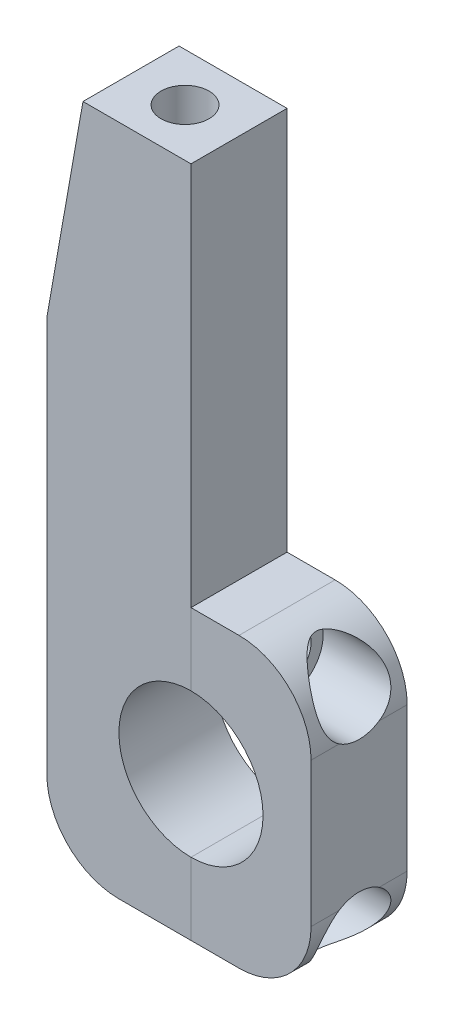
ISO-10303-21;
HEADER;
FILE_DESCRIPTION(('STEP AP214'),'2;1');
FILE_NAME('part.step','',(''),(''),'','','');
FILE_SCHEMA(('AUTOMOTIVE_DESIGN { 1 0 10303 214 1 1 1 1 }'));
ENDSEC;
DATA;
#1=APPLICATION_CONTEXT('core data for automotive mechanical design processes');
#2=APPLICATION_PROTOCOL_DEFINITION('international standard','automotive_design',2000,#1);
#3=PRODUCT_CONTEXT('',#1,'mechanical');
#4=PRODUCT('Part','Part','',(#3));
#5=PRODUCT_RELATED_PRODUCT_CATEGORY('part','',(#4));
#6=PRODUCT_DEFINITION_FORMATION('','',#4);
#7=PRODUCT_DEFINITION_CONTEXT('part definition',#1,'design');
#8=PRODUCT_DEFINITION('design','',#6,#7);
#9=PRODUCT_DEFINITION_SHAPE('','',#8);
#10=(LENGTH_UNIT() NAMED_UNIT(*) SI_UNIT(.MILLI.,.METRE.));
#11=(NAMED_UNIT(*) PLANE_ANGLE_UNIT() SI_UNIT($,.RADIAN.));
#12=(NAMED_UNIT(*) SI_UNIT($,.STERADIAN.) SOLID_ANGLE_UNIT());
#13=UNCERTAINTY_MEASURE_WITH_UNIT(LENGTH_MEASURE(1.E-05),#10,'distance_accuracy_value','');
#14=(GEOMETRIC_REPRESENTATION_CONTEXT(3) GLOBAL_UNCERTAINTY_ASSIGNED_CONTEXT((#13)) GLOBAL_UNIT_ASSIGNED_CONTEXT((#10,
#11,#12)) REPRESENTATION_CONTEXT('',''));
#15=CARTESIAN_POINT('',(0.,0.,0.));
#16=DIRECTION('',(0.,0.,1.));
#17=DIRECTION('',(1.,0.,0.));
#18=AXIS2_PLACEMENT_3D('',#15,#16,#17);
#19=CARTESIAN_POINT('',(15.875,19.05,6.35));
#20=DIRECTION('',(-1.,0.,0.));
#21=DIRECTION('',(0.,0.,1.));
#22=AXIS2_PLACEMENT_3D('',#19,#20,#21);
#23=PLANE('',#22);
#24=CARTESIAN_POINT('',(15.875,-13.4874,0.));
#25=DIRECTION('',(-1.,0.,0.));
#26=DIRECTION('',(0.,0.,1.));
#27=AXIS2_PLACEMENT_3D('',#24,#25,#26);
#28=CIRCLE('',#27,4.7625);
#29=CARTESIAN_POINT('',(15.875,-9.525,-2.64211893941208));
#30=VERTEX_POINT('',#29);
#31=CARTESIAN_POINT('',(15.875,-9.525,2.64211893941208));
#32=VERTEX_POINT('',#31);
#33=EDGE_CURVE('E63',#30,#32,#28,.F.);
#34=ORIENTED_EDGE('',*,*,#33,.F.);
#35=DIRECTION('',(0.,0.,-1.));
#36=VECTOR('',#35,1.);
#37=CARTESIAN_POINT('',(15.875,-9.525,6.35));
#38=LINE('',#37,#36);
#39=CARTESIAN_POINT('',(15.875,-9.525,-6.35));
#40=VERTEX_POINT('',#39);
#41=EDGE_CURVE('E129',#30,#40,#38,.T.);
#42=ORIENTED_EDGE('',*,*,#41,.T.);
#43=DIRECTION('',(0.,1.,0.));
#44=VECTOR('',#43,1.);
#45=CARTESIAN_POINT('',(15.875,19.05,-6.35));
#46=LINE('',#45,#44);
#47=CARTESIAN_POINT('',(15.875,9.525,-6.35));
#48=VERTEX_POINT('',#47);
#49=EDGE_CURVE('E361',#40,#48,#46,.T.);
#50=ORIENTED_EDGE('',*,*,#49,.T.);
#51=DIRECTION('',(0.,0.,-1.));
#52=VECTOR('',#51,1.);
#53=CARTESIAN_POINT('',(15.875,9.525,6.35));
#54=LINE('',#53,#52);
#55=CARTESIAN_POINT('',(15.875,9.525,-2.64211893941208));
#56=VERTEX_POINT('',#55);
#57=EDGE_CURVE('E140',#48,#56,#54,.F.);
#58=ORIENTED_EDGE('',*,*,#57,.T.);
#59=CARTESIAN_POINT('',(15.875,13.4874,0.));
#60=DIRECTION('',(-1.,0.,0.));
#61=DIRECTION('',(0.,0.,1.));
#62=AXIS2_PLACEMENT_3D('',#59,#60,#61);
#63=CIRCLE('',#62,4.7625);
#64=CARTESIAN_POINT('',(15.875,9.525,2.64211893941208));
#65=VERTEX_POINT('',#64);
#66=EDGE_CURVE('E57',#65,#56,#63,.F.);
#67=ORIENTED_EDGE('',*,*,#66,.F.);
#68=CARTESIAN_POINT('',(15.875,9.525,6.35));
#69=VERTEX_POINT('',#68);
#70=EDGE_CURVE('E144',#65,#69,#54,.F.);
#71=ORIENTED_EDGE('',*,*,#70,.T.);
#72=DIRECTION('',(0.,1.,0.));
#73=VECTOR('',#72,1.);
#74=CARTESIAN_POINT('',(15.875,19.05,6.35));
#75=LINE('',#74,#73);
#76=CARTESIAN_POINT('',(15.875,-9.525,6.35));
#77=VERTEX_POINT('',#76);
#78=EDGE_CURVE('E374',#77,#69,#75,.T.);
#79=ORIENTED_EDGE('',*,*,#78,.F.);
#80=EDGE_CURVE('E132',#77,#32,#38,.T.);
#81=ORIENTED_EDGE('',*,*,#80,.T.);
#82=EDGE_LOOP('',(#34,#42,#50,#58,#67,#71,#79,#81));
#83=FACE_BOUND('',#82,.T.);
#84=ADVANCED_FACE('F45',(#83),#23,.F.);
#85=CARTESIAN_POINT('',(6.35,-9.525,6.35));
#86=DIRECTION('',(0.,0.,-1.));
#87=DIRECTION('',(-1.,0.,0.));
#88=AXIS2_PLACEMENT_3D('',#85,#86,#87);
#89=CYLINDRICAL_SURFACE('',#88,9.525);
#90=ORIENTED_EDGE('',*,*,#41,.F.);
#91=CARTESIAN_POINT('',(15.0116979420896,-13.4874,4.7625));
#92=CARTESIAN_POINT('',(15.0647761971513,-13.3713743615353,4.76250056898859));
#93=CARTESIAN_POINT('',(15.1155152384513,-13.2542864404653,4.75825781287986));
#94=CARTESIAN_POINT('',(15.2120472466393,-13.0187005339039,4.74085180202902));
#95=CARTESIAN_POINT('',(15.2578393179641,-12.9002022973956,4.7276869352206));
#96=CARTESIAN_POINT('',(15.3442244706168,-12.6627549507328,4.69209677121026));
#97=CARTESIAN_POINT('',(15.3848197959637,-12.5438060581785,4.66967548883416));
#98=CARTESIAN_POINT('',(15.4607111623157,-12.3063841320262,4.6153478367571));
#99=CARTESIAN_POINT('',(15.4960074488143,-12.1879110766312,4.58344190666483));
#100=CARTESIAN_POINT('',(15.5613783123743,-11.9521663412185,4.50996081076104));
#101=CARTESIAN_POINT('',(15.5914390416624,-11.8348985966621,4.4683606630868));
#102=CARTESIAN_POINT('',(15.6463413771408,-11.6029479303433,4.37559688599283));
#103=CARTESIAN_POINT('',(15.6711828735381,-11.4882650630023,4.32443305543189));
#104=CARTESIAN_POINT('',(15.7158842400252,-11.2625487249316,4.21275415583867));
#105=CARTESIAN_POINT('',(15.7357443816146,-11.1515150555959,4.15223959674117));
#106=CARTESIAN_POINT('',(15.7708453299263,-10.9340546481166,4.02217488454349));
#107=CARTESIAN_POINT('',(15.7860844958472,-10.8276295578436,3.9526215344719));
#108=CARTESIAN_POINT('',(15.8119510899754,-10.623778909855,3.80739060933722));
#109=CARTESIAN_POINT('',(15.8227141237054,-10.5261722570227,3.73199091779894));
#110=CARTESIAN_POINT('',(15.8408114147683,-10.3368912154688,3.57364400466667));
#111=CARTESIAN_POINT('',(15.8481444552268,-10.2452189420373,3.49069411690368));
#112=CARTESIAN_POINT('',(15.8598913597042,-10.0685351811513,3.31783676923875));
#113=CARTESIAN_POINT('',(15.8643059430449,-9.98352205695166,3.22793102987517));
#114=CARTESIAN_POINT('',(15.8707583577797,-9.82068419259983,3.04169497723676));
#115=CARTESIAN_POINT('',(15.8727952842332,-9.74286219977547,2.9453622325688));
#116=CARTESIAN_POINT('',(15.8750714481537,-9.59223506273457,2.74327447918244));
#117=CARTESIAN_POINT('',(15.8752420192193,-9.51971856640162,2.63730348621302));
#118=CARTESIAN_POINT('',(15.8741921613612,-9.38345703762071,2.4198206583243));
#119=CARTESIAN_POINT('',(15.8729712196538,-9.3197152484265,2.30830679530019));
#120=CARTESIAN_POINT('',(15.8696873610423,-9.20146132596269,2.0805285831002));
#121=CARTESIAN_POINT('',(15.8676246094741,-9.14694738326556,1.96426517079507));
#122=CARTESIAN_POINT('',(15.863152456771,-9.04746845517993,1.72768268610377));
#123=CARTESIAN_POINT('',(15.8607429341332,-9.00250683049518,1.60736220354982));
#124=CARTESIAN_POINT('',(15.8559151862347,-8.92089805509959,1.35876254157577));
#125=CARTESIAN_POINT('',(15.8535002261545,-8.88463956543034,1.23035551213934));
#126=CARTESIAN_POINT('',(15.8491474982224,-8.82301939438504,0.970944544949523));
#127=CARTESIAN_POINT('',(15.8472097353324,-8.79765782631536,0.839940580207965));
#128=CARTESIAN_POINT('',(15.8440900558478,-8.75800879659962,0.57623434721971));
#129=CARTESIAN_POINT('',(15.8429082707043,-8.74372326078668,0.443531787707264));
#130=CARTESIAN_POINT('',(15.8414616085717,-8.72633993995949,0.177437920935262));
#131=CARTESIAN_POINT('',(15.8411964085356,-8.72323821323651,0.0440468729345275));
#132=CARTESIAN_POINT('',(15.841617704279,-8.72824110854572,-0.222899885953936));
#133=CARTESIAN_POINT('',(15.842306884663,-8.73637734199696,-0.356455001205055));
#134=CARTESIAN_POINT('',(15.8445490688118,-8.76384815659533,-0.62235193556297));
#135=CARTESIAN_POINT('',(15.8461017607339,-8.78317869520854,-0.754694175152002));
#136=CARTESIAN_POINT('',(15.8498554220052,-8.8329068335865,-1.01733529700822));
#137=CARTESIAN_POINT('',(15.85205668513,-8.86330945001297,-1.1476332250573));
#138=CARTESIAN_POINT('',(15.8567740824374,-8.93495061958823,-1.40515738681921));
#139=CARTESIAN_POINT('',(15.8592901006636,-8.97618518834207,-1.53238473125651));
#140=CARTESIAN_POINT('',(15.8642043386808,-9.06924559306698,-1.78303234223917));
#141=CARTESIAN_POINT('',(15.866602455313,-9.12108050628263,-1.90644924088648));
#142=CARTESIAN_POINT('',(15.8707525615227,-9.23493536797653,-2.14844720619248));
#143=CARTESIAN_POINT('',(15.8725047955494,-9.29695145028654,-2.26703008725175));
#144=CARTESIAN_POINT('',(15.8747690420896,-9.43077633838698,-2.49862043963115));
#145=CARTESIAN_POINT('',(15.8752805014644,-9.50258949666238,-2.61162540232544));
#146=CARTESIAN_POINT('',(15.8744131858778,-9.65544023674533,-2.83114297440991));
#147=CARTESIAN_POINT('',(15.8730351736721,-9.73647408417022,-2.93765818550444));
#148=CARTESIAN_POINT('',(15.8677219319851,-9.90687990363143,-3.14309214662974));
#149=CARTESIAN_POINT('',(15.8637958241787,-9.99622116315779,-3.24203659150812));
#150=CARTESIAN_POINT('',(15.8527214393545,-10.1827479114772,-3.43196573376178));
#151=CARTESIAN_POINT('',(15.8455744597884,-10.2799302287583,-3.52295361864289));
#152=CARTESIAN_POINT('',(15.8274075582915,-10.4813422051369,-3.6963053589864));
#153=CARTESIAN_POINT('',(15.8163883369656,-10.5855705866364,-3.77867077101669));
#154=CARTESIAN_POINT('',(15.7898765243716,-10.8001624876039,-3.93417279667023));
#155=CARTESIAN_POINT('',(15.7743841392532,-10.9105257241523,-4.00730983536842));
#156=CARTESIAN_POINT('',(15.7391800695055,-11.1315180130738,-4.14091526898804));
#157=CARTESIAN_POINT('',(15.7196771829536,-11.2419338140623,-4.20179171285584));
#158=CARTESIAN_POINT('',(15.6757434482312,-11.4664466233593,-4.31426894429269));
#159=CARTESIAN_POINT('',(15.6513127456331,-11.5805435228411,-4.36587000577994));
#160=CARTESIAN_POINT('',(15.597284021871,-11.8113521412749,-4.45957171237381));
#161=CARTESIAN_POINT('',(15.567687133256,-11.9280632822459,-4.50167443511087));
#162=CARTESIAN_POINT('',(15.5032012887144,-12.1630634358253,-4.57632387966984));
#163=CARTESIAN_POINT('',(15.4683123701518,-12.281352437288,-4.60887066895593));
#164=CARTESIAN_POINT('',(15.3943355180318,-12.5150147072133,-4.6636731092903));
#165=CARTESIAN_POINT('',(15.3553998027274,-12.6303723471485,-4.68620132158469));
#166=CARTESIAN_POINT('',(15.2726453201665,-12.8607221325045,-4.7225309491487));
#167=CARTESIAN_POINT('',(15.2288249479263,-12.9757141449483,-4.73632948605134));
#168=CARTESIAN_POINT('',(15.0903080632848,-13.3188440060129,-4.76503623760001));
#169=CARTESIAN_POINT('',(14.988503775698,-13.5453010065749,-4.76729309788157));
#170=CARTESIAN_POINT('',(14.7604869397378,-14.0038019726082,-4.74039173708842));
#171=CARTESIAN_POINT('',(14.6330481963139,-14.2350837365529,-4.70897111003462));
#172=CARTESIAN_POINT('',(14.3625256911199,-14.6818697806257,-4.61592378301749));
#173=CARTESIAN_POINT('',(14.2194345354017,-14.8973665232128,-4.55428275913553));
#174=CARTESIAN_POINT('',(13.9594245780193,-15.2572097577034,-4.42445818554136));
#175=CARTESIAN_POINT('',(13.8451899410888,-15.4056423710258,-4.36199462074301));
#176=CARTESIAN_POINT('',(13.6112985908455,-15.6921186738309,-4.22443753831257));
#177=CARTESIAN_POINT('',(13.4916396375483,-15.8301580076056,-4.14933876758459));
#178=CARTESIAN_POINT('',(13.2478912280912,-16.0959467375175,-3.98762667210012));
#179=CARTESIAN_POINT('',(13.123790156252,-16.2236658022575,-3.90098125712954));
#180=CARTESIAN_POINT('',(12.8727467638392,-16.4683503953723,-3.71735609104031));
#181=CARTESIAN_POINT('',(12.7458048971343,-16.5853176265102,-3.62037798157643));
#182=CARTESIAN_POINT('',(12.487794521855,-16.8108106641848,-3.41468970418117));
#183=CARTESIAN_POINT('',(12.3566942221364,-16.9191213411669,-3.30578397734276));
#184=CARTESIAN_POINT('',(12.0943317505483,-17.1247403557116,-3.07810133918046));
#185=CARTESIAN_POINT('',(11.9630695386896,-17.2220449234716,-2.95932106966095));
#186=CARTESIAN_POINT('',(11.7027964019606,-17.4052553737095,-2.71208655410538));
#187=CARTESIAN_POINT('',(11.5737791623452,-17.491200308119,-2.5836679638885));
#188=CARTESIAN_POINT('',(11.3202360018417,-17.6517967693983,-2.31594237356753));
#189=CARTESIAN_POINT('',(11.1957064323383,-17.7264576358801,-2.17664452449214));
#190=CARTESIAN_POINT('',(10.9792505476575,-17.8501404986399,-1.91428938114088));
#191=CARTESIAN_POINT('',(10.8857768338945,-17.9013057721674,-1.7935376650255));
#192=CARTESIAN_POINT('',(10.707713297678,-17.9953061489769,-1.54216274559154));
#193=CARTESIAN_POINT('',(10.6231383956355,-18.0381273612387,-1.41152357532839));
#194=CARTESIAN_POINT('',(10.4675221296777,-18.1144840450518,-1.13669249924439));
#195=CARTESIAN_POINT('',(10.396696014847,-18.1478750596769,-0.992330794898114));
#196=CARTESIAN_POINT('',(10.3089733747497,-18.1883259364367,-0.767125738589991));
#197=CARTESIAN_POINT('',(10.2828465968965,-18.2001919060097,-0.690747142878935));
#198=CARTESIAN_POINT('',(10.2380561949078,-18.2203572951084,-0.535404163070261));
#199=CARTESIAN_POINT('',(10.2193871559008,-18.2286593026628,-0.456441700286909));
#200=CARTESIAN_POINT('',(10.1854841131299,-18.2436686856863,-0.267044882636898));
#201=CARTESIAN_POINT('',(10.1740559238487,-18.2486588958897,-0.155743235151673));
#202=CARTESIAN_POINT('',(10.169327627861,-18.250730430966,0.0672946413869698));
#203=CARTESIAN_POINT('',(10.1760241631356,-18.2478132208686,0.179030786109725));
#204=CARTESIAN_POINT('',(10.2063908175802,-18.2344270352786,0.399073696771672));
#205=CARTESIAN_POINT('',(10.2299815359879,-18.2239933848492,0.507394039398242));
#206=CARTESIAN_POINT('',(10.2910327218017,-18.1965056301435,0.71914385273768));
#207=CARTESIAN_POINT('',(10.3285103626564,-18.1794433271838,0.822567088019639));
#208=CARTESIAN_POINT('',(10.4482852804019,-18.1236481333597,1.10500007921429));
#209=CARTESIAN_POINT('',(10.5423551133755,-18.0785349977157,1.27771447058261));
#210=CARTESIAN_POINT('',(10.6973905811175,-18.0002161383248,1.52426005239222));
#211=CARTESIAN_POINT('',(10.7515416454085,-17.9722528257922,1.60453649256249));
#212=CARTESIAN_POINT('',(10.8633874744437,-17.9130237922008,1.76132616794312));
#213=CARTESIAN_POINT('',(10.9210812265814,-17.8817590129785,1.83784046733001));
#214=CARTESIAN_POINT('',(11.0961405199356,-17.7843807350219,2.05992259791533));
#215=CARTESIAN_POINT('',(11.2172006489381,-17.7138331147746,2.20062745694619));
#216=CARTESIAN_POINT('',(11.4646092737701,-17.5616397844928,2.47103759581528));
#217=CARTESIAN_POINT('',(11.5909622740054,-17.4799844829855,2.60073321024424));
#218=CARTESIAN_POINT('',(11.8462006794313,-17.3058291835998,2.85029334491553));
#219=CARTESIAN_POINT('',(11.9750886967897,-17.2133174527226,2.97014698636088));
#220=CARTESIAN_POINT('',(12.2332244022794,-17.0176321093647,3.20025968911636));
#221=CARTESIAN_POINT('',(12.3624719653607,-16.9144618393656,3.31052173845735));
#222=CARTESIAN_POINT('',(12.6289524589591,-16.6896965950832,3.52887489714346));
#223=CARTESIAN_POINT('',(12.7661027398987,-16.5673142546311,3.63625935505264));
#224=CARTESIAN_POINT('',(13.0374956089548,-16.3101298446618,3.83932875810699));
#225=CARTESIAN_POINT('',(13.1717375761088,-16.1753251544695,3.9350112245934));
#226=CARTESIAN_POINT('',(13.4354869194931,-15.8935690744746,4.11333202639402));
#227=CARTESIAN_POINT('',(13.5650025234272,-15.7466404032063,4.19599395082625));
#228=CARTESIAN_POINT('',(13.8179410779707,-15.4406437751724,4.3468745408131));
#229=CARTESIAN_POINT('',(13.9413664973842,-15.2815808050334,4.4150990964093));
#230=CARTESIAN_POINT('',(14.1509833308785,-14.9925260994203,4.52033991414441));
#231=CARTESIAN_POINT('',(14.2388526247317,-14.8650347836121,4.56090347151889));
#232=CARTESIAN_POINT('',(14.4094414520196,-14.6039102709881,4.63174932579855));
#233=CARTESIAN_POINT('',(14.4921623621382,-14.4702787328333,4.66203438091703));
#234=CARTESIAN_POINT('',(14.6516106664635,-14.197664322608,4.71127301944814));
#235=CARTESIAN_POINT('',(14.7283450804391,-14.0586880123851,4.73024005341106));
#236=CARTESIAN_POINT('',(14.8751727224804,-13.7761617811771,4.7558518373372));
#237=CARTESIAN_POINT('',(14.9452674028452,-13.6326128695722,4.76249928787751));
#238=CARTESIAN_POINT('',(15.0116979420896,-13.4874,4.7625));
#239=B_SPLINE_CURVE_WITH_KNOTS('',3,(#91,#92,#93,#94,#95,#96,#97,#98,#99,#100,#101,#102,#103,
#104,#105,#106,#107,#108,#109,#110,#111,#112,#113,#114,#115,#116,#117,#118,#119,#120,#121,#122,
#123,#124,#125,#126,#127,#128,#129,#130,#131,#132,#133,#134,#135,#136,#137,#138,#139,#140,#141,
#142,#143,#144,#145,#146,#147,#148,#149,#150,#151,#152,#153,#154,#155,#156,#157,#158,#159,#160,
#161,#162,#163,#164,#165,#166,#167,#168,#169,#170,#171,#172,#173,#174,#175,#176,#177,#178,#179,
#180,#181,#182,#183,#184,#185,#186,#187,#188,#189,#190,#191,#192,#193,#194,#195,#196,#197,#198,
#199,#200,#201,#202,#203,#204,#205,#206,#207,#208,#209,#210,#211,#212,#213,#214,#215,#216,#217,
#218,#219,#220,#221,#222,#223,#224,#225,#226,#227,#228,#229,#230,#231,#232,#233,#234,#235,#236,
#237,#238),.UNSPECIFIED.,.T.,.F.,(4,2,2,2,2,2,2,2,2,2,2,2,2,2,2,2,2,2,2,2,2,2,2,2,2,2,2,2,2,2,2,
2,2,2,2,2,2,2,2,2,2,2,2,2,2,2,2,2,2,2,2,2,2,2,2,2,2,2,2,2,2,2,2,2,2,2,2,2,2,2,2,2,2,4),(0.,
0.382653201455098,0.765375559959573,1.14793209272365,1.53047089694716,1.91400661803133,
2.29755040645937,2.68107328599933,3.06473218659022,3.43572889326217,3.80685712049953,
4.17789384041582,4.54907173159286,4.9338618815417,5.31879387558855,5.70365030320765,
6.08864190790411,6.48851807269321,6.88839839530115,7.28834823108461,7.68815709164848,
8.08909287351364,8.48988395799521,8.89085686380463,9.29168248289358,9.69285278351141,
10.0938710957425,10.4950681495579,10.8961032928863,11.2957106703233,11.6951572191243,
12.0945315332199,12.4938874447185,12.8761629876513,13.258427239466,13.6406077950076,
14.0227856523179,14.393812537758,14.764961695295,15.5067340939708,16.3016528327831,
17.0969487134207,17.6885363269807,18.2803705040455,18.8738852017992,19.4673057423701,
20.0725727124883,20.6780463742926,21.2813811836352,21.8842138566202,22.3667587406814,
22.8501002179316,23.3404873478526,23.5848734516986,23.829081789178,24.1633503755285,
24.4975570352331,24.8302031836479,25.1632620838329,25.7648784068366,26.0671802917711,
26.3693961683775,26.9641992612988,27.5595192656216,28.1554886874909,28.7512717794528,
29.389244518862,30.0273521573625,30.6642901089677,31.3009677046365,31.7806855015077,
32.2602744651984,32.7392923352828,33.2182051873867),.UNSPECIFIED.);
#240=EDGE_CURVE('E12',#30,#32,#239,.T.);
#241=ORIENTED_EDGE('',*,*,#240,.T.);
#242=ORIENTED_EDGE('',*,*,#80,.F.);
#243=CARTESIAN_POINT('',(6.35,-9.525,6.35));
#244=DIRECTION('',(0.,0.,1.));
#245=DIRECTION('',(1.,0.,0.));
#246=AXIS2_PLACEMENT_3D('',#243,#244,#245);
#247=CIRCLE('',#246,9.525);
#248=CARTESIAN_POINT('',(6.35,-19.05,6.35));
#249=VERTEX_POINT('',#248);
#250=EDGE_CURVE('E154',#249,#77,#247,.T.);
#251=ORIENTED_EDGE('',*,*,#250,.F.);
#252=DIRECTION('',(0.,0.,-1.));
#253=VECTOR('',#252,1.);
#254=CARTESIAN_POINT('',(6.35,-19.05,6.35));
#255=LINE('',#254,#253);
#256=CARTESIAN_POINT('',(6.35,-19.05,-6.35));
#257=VERTEX_POINT('',#256);
#258=EDGE_CURVE('E150',#257,#249,#255,.F.);
#259=ORIENTED_EDGE('',*,*,#258,.F.);
#260=CARTESIAN_POINT('',(6.35,-9.525,-6.35));
#261=DIRECTION('',(0.,0.,1.));
#262=DIRECTION('',(1.,0.,0.));
#263=AXIS2_PLACEMENT_3D('',#260,#261,#262);
#264=CIRCLE('',#263,9.525);
#265=EDGE_CURVE('E138',#40,#257,#264,.F.);
#266=ORIENTED_EDGE('',*,*,#265,.F.);
#267=EDGE_LOOP('',(#90,#241,#242,#251,#259,#266));
#268=FACE_BOUND('',#267,.T.);
#269=ADVANCED_FACE('F136',(#268),#89,.T.);
#270=CARTESIAN_POINT('',(25.4,-13.4874,0.));
#271=DIRECTION('',(-1.,0.,0.));
#272=DIRECTION('',(0.,0.,1.));
#273=AXIS2_PLACEMENT_3D('',#270,#271,#272);
#274=CYLINDRICAL_SURFACE('',#273,3.175);
#275=CARTESIAN_POINT('',(0.,-13.4874,0.));
#276=DIRECTION('',(1.,0.,0.));
#277=DIRECTION('',(0.,0.,-1.));
#278=AXIS2_PLACEMENT_3D('',#275,#276,#277);
#279=CIRCLE('',#278,3.175);
#280=CARTESIAN_POINT('',(0.,-13.4874,3.175));
#281=VERTEX_POINT('',#280);
#282=EDGE_CURVE('E370',#281,#281,#279,.F.);
#283=CARTESIAN_POINT('',(6.35,-13.4874,0.));
#284=DIRECTION('',(1.,0.,0.));
#285=DIRECTION('',(0.,0.,-1.));
#286=AXIS2_PLACEMENT_3D('',#283,#284,#285);
#287=CIRCLE('',#286,3.175);
#288=CARTESIAN_POINT('',(6.34999999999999,-13.4874,3.175));
#289=VERTEX_POINT('',#288);
#290=EDGE_CURVE('E134',#289,#289,#287,.T.);
#291=CARTESIAN_POINT('',(0.,-13.4874,3.175));
#292=CARTESIAN_POINT('',(0.066145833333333,-13.4874,3.175));
#293=CARTESIAN_POINT('',(0.132291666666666,-13.4874,3.175));
#294=CARTESIAN_POINT('',(0.264583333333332,-13.4874,3.175));
#295=CARTESIAN_POINT('',(0.330729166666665,-13.4874,3.175));
#296=CARTESIAN_POINT('',(0.463020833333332,-13.4874,3.175));
#297=CARTESIAN_POINT('',(0.529166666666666,-13.4874,3.175));
#298=CARTESIAN_POINT('',(0.661458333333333,-13.4874,3.175));
#299=CARTESIAN_POINT('',(0.727604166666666,-13.4874,3.175));
#300=CARTESIAN_POINT('',(0.859895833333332,-13.4874,3.175));
#301=CARTESIAN_POINT('',(0.926041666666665,-13.4874,3.175));
#302=CARTESIAN_POINT('',(1.05833333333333,-13.4874,3.175));
#303=CARTESIAN_POINT('',(1.12447916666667,-13.4874,3.175));
#304=CARTESIAN_POINT('',(1.25677083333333,-13.4874,3.175));
#305=CARTESIAN_POINT('',(1.32291666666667,-13.4874,3.175));
#306=CARTESIAN_POINT('',(1.45520833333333,-13.4874,3.175));
#307=CARTESIAN_POINT('',(1.52135416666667,-13.4874,3.175));
#308=CARTESIAN_POINT('',(1.65364583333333,-13.4874,3.175));
#309=CARTESIAN_POINT('',(1.71979166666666,-13.4874,3.175));
#310=CARTESIAN_POINT('',(1.85208333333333,-13.4874,3.175));
#311=CARTESIAN_POINT('',(1.91822916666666,-13.4874,3.175));
#312=CARTESIAN_POINT('',(2.05052083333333,-13.4874,3.175));
#313=CARTESIAN_POINT('',(2.11666666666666,-13.4874,3.175));
#314=CARTESIAN_POINT('',(2.24895833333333,-13.4874,3.175));
#315=CARTESIAN_POINT('',(2.31510416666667,-13.4874,3.175));
#316=CARTESIAN_POINT('',(2.44739583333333,-13.4874,3.175));
#317=CARTESIAN_POINT('',(2.51354166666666,-13.4874,3.175));
#318=CARTESIAN_POINT('',(2.64583333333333,-13.4874,3.175));
#319=CARTESIAN_POINT('',(2.71197916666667,-13.4874,3.175));
#320=CARTESIAN_POINT('',(2.84427083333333,-13.4874,3.175));
#321=CARTESIAN_POINT('',(2.91041666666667,-13.4874,3.175));
#322=CARTESIAN_POINT('',(3.04270833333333,-13.4874,3.175));
#323=CARTESIAN_POINT('',(3.10885416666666,-13.4874,3.175));
#324=CARTESIAN_POINT('',(3.24114583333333,-13.4874,3.175));
#325=CARTESIAN_POINT('',(3.30729166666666,-13.4874,3.175));
#326=CARTESIAN_POINT('',(3.43958333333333,-13.4874,3.175));
#327=CARTESIAN_POINT('',(3.50572916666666,-13.4874,3.175));
#328=CARTESIAN_POINT('',(3.63802083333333,-13.4874,3.175));
#329=CARTESIAN_POINT('',(3.70416666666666,-13.4874,3.175));
#330=CARTESIAN_POINT('',(3.83645833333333,-13.4874,3.175));
#331=CARTESIAN_POINT('',(3.90260416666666,-13.4874,3.175));
#332=CARTESIAN_POINT('',(4.03489583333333,-13.4874,3.175));
#333=CARTESIAN_POINT('',(4.10104166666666,-13.4874,3.175));
#334=CARTESIAN_POINT('',(4.23333333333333,-13.4874,3.175));
#335=CARTESIAN_POINT('',(4.29947916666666,-13.4874,3.175));
#336=CARTESIAN_POINT('',(4.43177083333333,-13.4874,3.175));
#337=CARTESIAN_POINT('',(4.49791666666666,-13.4874,3.175));
#338=CARTESIAN_POINT('',(4.63020833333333,-13.4874,3.175));
#339=CARTESIAN_POINT('',(4.69635416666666,-13.4874,3.175));
#340=CARTESIAN_POINT('',(4.82864583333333,-13.4874,3.175));
#341=CARTESIAN_POINT('',(4.89479166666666,-13.4874,3.175));
#342=CARTESIAN_POINT('',(5.02708333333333,-13.4874,3.175));
#343=CARTESIAN_POINT('',(5.09322916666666,-13.4874,3.175));
#344=CARTESIAN_POINT('',(5.22552083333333,-13.4874,3.175));
#345=CARTESIAN_POINT('',(5.29166666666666,-13.4874,3.175));
#346=CARTESIAN_POINT('',(5.42395833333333,-13.4874,3.175));
#347=CARTESIAN_POINT('',(5.49010416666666,-13.4874,3.175));
#348=CARTESIAN_POINT('',(5.62239583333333,-13.4874,3.175));
#349=CARTESIAN_POINT('',(5.68854166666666,-13.4874,3.175));
#350=CARTESIAN_POINT('',(5.82083333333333,-13.4874,3.175));
#351=CARTESIAN_POINT('',(5.88697916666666,-13.4874,3.175));
#352=CARTESIAN_POINT('',(6.01927083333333,-13.4874,3.175));
#353=CARTESIAN_POINT('',(6.08541666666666,-13.4874,3.175));
#354=CARTESIAN_POINT('',(6.21770833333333,-13.4874,3.175));
#355=CARTESIAN_POINT('',(6.28385416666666,-13.4874,3.175));
#356=CARTESIAN_POINT('',(6.34999999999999,-13.4874,3.175));
#357=B_SPLINE_CURVE_WITH_KNOTS('',3,(#291,#292,#293,#294,#295,#296,#297,#298,#299,#300,#301,
#302,#303,#304,#305,#306,#307,#308,#309,#310,#311,#312,#313,#314,#315,#316,#317,#318,#319,#320,
#321,#322,#323,#324,#325,#326,#327,#328,#329,#330,#331,#332,#333,#334,#335,#336,#337,#338,#339,
#340,#341,#342,#343,#344,#345,#346,#347,#348,#349,#350,#351,#352,#353,#354,#355,#356),
.UNSPECIFIED.,.F.,.F.,(4,2,2,2,2,2,2,2,2,2,2,2,2,2,2,2,2,2,2,2,2,2,2,2,2,2,2,2,2,2,2,2,4),(0.,
0.198437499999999,0.396874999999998,0.5953125,0.793749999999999,0.992187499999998,1.190625,
1.3890625,1.5875,1.7859375,1.984375,2.1828125,2.38125,2.5796875,2.778125,2.9765625,3.175,
3.3734375,3.571875,3.7703125,3.96875,4.1671875,4.365625,4.5640625,4.7625,4.96093749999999,
5.15937499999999,5.3578125,5.55625,5.75468749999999,5.953125,6.1515625,6.34999999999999),.UNSPECIFIED.);
#358=EDGE_CURVE('BSEAM191',#281,#289,#357,.T.);
#359=ORIENTED_EDGE('',*,*,#282,.T.);
#360=ORIENTED_EDGE('',*,*,#290,.T.);
#361=ORIENTED_EDGE('',*,*,#358,.T.);
#362=ORIENTED_EDGE('',*,*,#358,.F.);
#363=EDGE_LOOP('',(#359,#361,#360,#362));
#364=FACE_BOUND('',#363,.T.);
#365=ADVANCED_FACE('F191',(#364),#274,.F.);
#366=CARTESIAN_POINT('',(6.35,9.525,6.35));
#367=DIRECTION('',(0.,0.,-1.));
#368=DIRECTION('',(-1.,0.,0.));
#369=AXIS2_PLACEMENT_3D('',#366,#367,#368);
#370=CYLINDRICAL_SURFACE('',#369,9.525);
#371=ORIENTED_EDGE('',*,*,#70,.F.);
#372=CARTESIAN_POINT('',(15.0116979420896,13.4874,4.7625));
#373=CARTESIAN_POINT('',(14.9449310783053,13.6333500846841,4.76249995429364));
#374=CARTESIAN_POINT('',(14.8744692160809,13.7776027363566,4.75578518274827));
#375=CARTESIAN_POINT('',(14.7268165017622,14.0615406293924,4.72991645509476));
#376=CARTESIAN_POINT('',(14.6496219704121,14.2012233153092,4.71075566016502));
#377=CARTESIAN_POINT('',(14.489108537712,14.4753357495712,4.66099130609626));
#378=CARTESIAN_POINT('',(14.4057758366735,14.6097525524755,4.63036128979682));
#379=CARTESIAN_POINT('',(14.2339084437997,14.8723596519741,4.55870887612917));
#380=CARTESIAN_POINT('',(14.1453724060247,15.000548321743,4.51768378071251));
#381=CARTESIAN_POINT('',(13.9428268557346,15.2791933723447,4.41562108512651));
#382=CARTESIAN_POINT('',(13.8276690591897,15.4279253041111,4.35214895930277));
#383=CARTESIAN_POINT('',(13.5919796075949,15.7148181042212,4.21253858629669));
#384=CARTESIAN_POINT('',(13.471446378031,15.8529758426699,4.13639660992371));
#385=CARTESIAN_POINT('',(13.2261057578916,16.1187513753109,3.97263190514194));
#386=CARTESIAN_POINT('',(13.1012912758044,16.2463503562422,3.88498937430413));
#387=CARTESIAN_POINT('',(12.8488738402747,16.490710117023,3.69933519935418));
#388=CARTESIAN_POINT('',(12.7212712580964,16.6074723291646,3.60132492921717));
#389=CARTESIAN_POINT('',(12.4620529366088,16.8324244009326,3.39354163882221));
#390=CARTESIAN_POINT('',(12.3304075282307,16.9404018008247,3.28357596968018));
#391=CARTESIAN_POINT('',(12.0670666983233,17.145275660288,3.05369842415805));
#392=CARTESIAN_POINT('',(11.9353712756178,17.2421681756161,2.9337830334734));
#393=CARTESIAN_POINT('',(11.6743951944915,17.4244734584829,2.68415230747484));
#394=CARTESIAN_POINT('',(11.5451077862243,17.5099245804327,2.55447211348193));
#395=CARTESIAN_POINT('',(11.2913104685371,17.6694128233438,2.28403911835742));
#396=CARTESIAN_POINT('',(11.1667964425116,17.7434599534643,2.14329619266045));
#397=CARTESIAN_POINT('',(10.9524237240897,17.8649712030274,1.88004152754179));
#398=CARTESIAN_POINT('',(10.8608299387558,17.9147387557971,1.76002604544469));
#399=CARTESIAN_POINT('',(10.6866867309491,18.006062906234,1.51024602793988));
#400=CARTESIAN_POINT('',(10.6041516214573,18.0476065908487,1.38046659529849));
#401=CARTESIAN_POINT('',(10.4527843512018,18.1215091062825,1.10754186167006));
#402=CARTESIAN_POINT('',(10.3841717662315,18.1537237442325,0.964227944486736));
#403=CARTESIAN_POINT('',(10.2997675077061,18.1925223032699,0.740882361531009));
#404=CARTESIAN_POINT('',(10.2747442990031,18.2038571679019,0.665168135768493));
#405=CARTESIAN_POINT('',(10.2321075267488,18.2230114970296,0.511276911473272));
#406=CARTESIAN_POINT('',(10.2144888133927,18.2308334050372,0.43310166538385));
#407=CARTESIAN_POINT('',(10.1826926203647,18.2448933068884,0.244338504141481));
#408=CARTESIAN_POINT('',(10.1724760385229,18.2493511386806,0.132899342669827));
#409=CARTESIAN_POINT('',(10.1701886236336,18.2503530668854,-0.0901807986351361));
#410=CARTESIAN_POINT('',(10.1781167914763,18.2468975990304,-0.201821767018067));
#411=CARTESIAN_POINT('',(10.2107682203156,18.2324898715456,-0.421429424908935));
#412=CARTESIAN_POINT('',(10.235405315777,18.2215760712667,-0.529411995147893));
#413=CARTESIAN_POINT('',(10.2983000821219,18.1932032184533,-0.740397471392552));
#414=CARTESIAN_POINT('',(10.3365737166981,18.1757364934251,-0.843394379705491));
#415=CARTESIAN_POINT('',(10.4596372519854,18.1182570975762,-1.12781753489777));
#416=CARTESIAN_POINT('',(10.5565280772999,18.0716176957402,-1.30262644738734));
#417=CARTESIAN_POINT('',(10.7157893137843,17.9907651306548,-1.5520245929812));
#418=CARTESIAN_POINT('',(10.7713535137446,17.9619129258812,-1.63320797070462));
#419=CARTESIAN_POINT('',(10.8860108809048,17.9008240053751,-1.79173029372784));
#420=CARTESIAN_POINT('',(10.9451030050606,17.868588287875,-1.86907036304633));
#421=CARTESIAN_POINT('',(11.123838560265,17.7684490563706,-2.09295785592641));
#422=CARTESIAN_POINT('',(11.2471020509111,17.6960376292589,-2.23459297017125));
#423=CARTESIAN_POINT('',(11.4987506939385,17.5398618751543,-2.50670009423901));
#424=CARTESIAN_POINT('',(11.6271401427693,17.4560878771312,-2.63716243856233));
#425=CARTESIAN_POINT('',(11.886288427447,17.2774150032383,-2.88806648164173));
#426=CARTESIAN_POINT('',(12.0170497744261,17.1825036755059,-3.00849670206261));
#427=CARTESIAN_POINT('',(12.2787462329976,16.9817285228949,-3.2395181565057));
#428=CARTESIAN_POINT('',(12.4096812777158,16.8758681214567,-3.35011244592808));
#429=CARTESIAN_POINT('',(12.6787723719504,16.6457884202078,-3.56829748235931));
#430=CARTESIAN_POINT('',(12.8168374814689,16.5208198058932,-3.67521320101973));
#431=CARTESIAN_POINT('',(13.0898099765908,16.2582356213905,-3.87702116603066));
#432=CARTESIAN_POINT('',(13.2247166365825,16.1206171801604,-3.97191067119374));
#433=CARTESIAN_POINT('',(13.4894237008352,15.8331175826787,-4.14817761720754));
#434=CARTESIAN_POINT('',(13.6192356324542,15.6832667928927,-4.22958708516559));
#435=CARTESIAN_POINT('',(13.8724241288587,15.3712865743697,-4.37745871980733));
#436=CARTESIAN_POINT('',(13.99580380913,15.2091631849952,-4.44392817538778));
#437=CARTESIAN_POINT('',(14.1979784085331,14.9245703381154,-4.54215580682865));
#438=CARTESIAN_POINT('',(14.2788857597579,14.8051044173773,-4.57831597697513));
#439=CARTESIAN_POINT('',(14.4361656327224,14.5609330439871,-4.64164109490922));
#440=CARTESIAN_POINT('',(14.512539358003,14.4362289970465,-4.66880843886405));
#441=CARTESIAN_POINT('',(14.6601358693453,14.1821287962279,-4.7133204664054));
#442=CARTESIAN_POINT('',(14.7313598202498,14.0527337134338,-4.73066737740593));
#443=CARTESIAN_POINT('',(14.8680784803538,13.7899612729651,-4.75470996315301));
#444=CARTESIAN_POINT('',(14.9335730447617,13.6565838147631,-4.76140536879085));
#445=CARTESIAN_POINT('',(15.0588192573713,13.3856417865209,-4.76335605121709));
#446=CARTESIAN_POINT('',(15.1185158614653,13.2480508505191,-4.75851108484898));
#447=CARTESIAN_POINT('',(15.2310351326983,12.9710390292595,-4.73646270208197));
#448=CARTESIAN_POINT('',(15.2838577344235,12.8316181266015,-4.71925916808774));
#449=CARTESIAN_POINT('',(15.3822625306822,12.5524976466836,-4.67197870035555));
#450=CARTESIAN_POINT('',(15.427849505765,12.4127983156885,-4.64191031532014));
#451=CARTESIAN_POINT('',(15.5116801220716,12.1346610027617,-4.56860770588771));
#452=CARTESIAN_POINT('',(15.5499248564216,11.9962228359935,-4.52537544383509));
#453=CARTESIAN_POINT('',(15.6145339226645,11.7406325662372,-4.43239863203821));
#454=CARTESIAN_POINT('',(15.6418029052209,11.6231081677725,-4.3842964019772));
#455=CARTESIAN_POINT('',(15.6911041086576,11.3913938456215,-4.27836282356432));
#456=CARTESIAN_POINT('',(15.7131365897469,11.2772037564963,-4.22053195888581));
#457=CARTESIAN_POINT('',(15.7522881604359,11.0532434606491,-4.09545338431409));
#458=CARTESIAN_POINT('',(15.7694077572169,10.9434727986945,-4.02820664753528));
#459=CARTESIAN_POINT('',(15.7991740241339,10.729335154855,-3.88472614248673));
#460=CARTESIAN_POINT('',(15.8118206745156,10.6249681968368,-3.80849233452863));
#461=CARTESIAN_POINT('',(15.8326886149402,10.4270528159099,-3.65115562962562));
#462=CARTESIAN_POINT('',(15.8410820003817,10.3332295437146,-3.57042111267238));
#463=CARTESIAN_POINT('',(15.8547740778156,10.1520236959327,-3.40176705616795));
#464=CARTESIAN_POINT('',(15.8600717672,10.0646432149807,-3.313845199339));
#465=CARTESIAN_POINT('',(15.8721177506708,9.81317319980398,-3.04018005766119));
#466=CARTESIAN_POINT('',(15.8750346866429,9.65958656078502,-2.84440315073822));
#467=CARTESIAN_POINT('',(15.8749629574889,9.37881045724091,-2.42240440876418));
#468=CARTESIAN_POINT('',(15.8717097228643,9.25307382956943,-2.19522400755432));
#469=CARTESIAN_POINT('',(15.863250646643,9.04010135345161,-1.72332361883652));
#470=CARTESIAN_POINT('',(15.858044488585,8.95287174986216,-1.47860079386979));
#471=CARTESIAN_POINT('',(15.8512262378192,8.85161390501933,-1.09947200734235));
#472=CARTESIAN_POINT('',(15.8490930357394,8.82258130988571,-0.968899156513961));
#473=CARTESIAN_POINT('',(15.8455037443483,8.77559461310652,-0.705778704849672));
#474=CARTESIAN_POINT('',(15.8440474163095,8.75763660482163,-0.573231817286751));
#475=CARTESIAN_POINT('',(15.8420174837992,8.7329277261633,-0.307051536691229));
#476=CARTESIAN_POINT('',(15.8414441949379,8.72618086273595,-0.173417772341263));
#477=CARTESIAN_POINT('',(15.8412564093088,8.72395108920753,0.0938968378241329));
#478=CARTESIAN_POINT('',(15.841641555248,8.72846398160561,0.227577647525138));
#479=CARTESIAN_POINT('',(15.8433187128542,8.74870938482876,0.494027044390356));
#480=CARTESIAN_POINT('',(15.8446103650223,8.76443744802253,0.626795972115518));
#481=CARTESIAN_POINT('',(15.8479227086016,8.80698639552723,0.890485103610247));
#482=CARTESIAN_POINT('',(15.8499431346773,8.83380324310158,1.02140596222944));
#483=CARTESIAN_POINT('',(15.854419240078,8.89835354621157,1.28058697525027));
#484=CARTESIAN_POINT('',(15.8568751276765,8.93609223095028,1.40884582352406));
#485=CARTESIAN_POINT('',(15.8618175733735,9.02219904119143,1.66169083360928));
#486=CARTESIAN_POINT('',(15.8643041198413,9.07056324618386,1.78627833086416));
#487=CARTESIAN_POINT('',(15.868818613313,9.17772668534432,2.03126631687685));
#488=CARTESIAN_POINT('',(15.8708453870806,9.23655194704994,2.15165544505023));
#489=CARTESIAN_POINT('',(15.8738546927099,9.36411646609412,2.38701673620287));
#490=CARTESIAN_POINT('',(15.8748376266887,9.43285189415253,2.50199096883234));
#491=CARTESIAN_POINT('',(15.8751257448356,9.5797905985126,2.72578798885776));
#492=CARTESIAN_POINT('',(15.8744303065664,9.6579973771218,2.83460847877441));
#493=CARTESIAN_POINT('',(15.870687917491,9.82324714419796,3.04520880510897));
#494=CARTESIAN_POINT('',(15.8676419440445,9.91028644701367,3.14699154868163));
#495=CARTESIAN_POINT('',(15.8585549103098,10.0917293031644,3.34191485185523));
#496=CARTESIAN_POINT('',(15.8525411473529,10.1860592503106,3.43512515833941));
#497=CARTESIAN_POINT('',(15.836880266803,10.3819573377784,3.61319033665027));
#498=CARTESIAN_POINT('',(15.8272346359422,10.4835225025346,3.69804860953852));
#499=CARTESIAN_POINT('',(15.8036982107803,10.6930431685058,3.8588094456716));
#500=CARTESIAN_POINT('',(15.7898076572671,10.8009983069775,3.93471251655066));
#501=CARTESIAN_POINT('',(15.7572411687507,11.0223120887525,4.07701512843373));
#502=CARTESIAN_POINT('',(15.7385655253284,11.1356704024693,4.14341524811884));
#503=CARTESIAN_POINT('',(15.6969842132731,11.361314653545,4.2634174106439));
#504=CARTESIAN_POINT('',(15.6743163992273,11.4734041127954,4.31747185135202));
#505=CARTESIAN_POINT('',(15.6239599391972,11.7005038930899,4.41630425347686));
#506=CARTESIAN_POINT('',(15.5962714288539,11.8155141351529,4.46108246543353));
#507=CARTESIAN_POINT('',(15.5357392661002,12.0473313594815,4.54121525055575));
#508=CARTESIAN_POINT('',(15.5028998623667,12.164136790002,4.57657752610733));
#509=CARTESIAN_POINT('',(15.4320236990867,12.3985814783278,4.63794832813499));
#510=CARTESIAN_POINT('',(15.3939881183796,12.5162205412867,4.66395897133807));
#511=CARTESIAN_POINT('',(15.3038334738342,12.7773089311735,4.71152199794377));
#512=CARTESIAN_POINT('',(15.2504574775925,12.9207377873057,4.73083158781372));
#513=CARTESIAN_POINT('',(15.1364192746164,13.2057649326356,4.75631849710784));
#514=CARTESIAN_POINT('',(15.0757594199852,13.3473637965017,4.76250004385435));
#515=CARTESIAN_POINT('',(15.0116979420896,13.4874,4.7625));
#516=B_SPLINE_CURVE_WITH_KNOTS('',3,(#372,#373,#374,#375,#376,#377,#378,#379,#380,#381,#382,
#383,#384,#385,#386,#387,#388,#389,#390,#391,#392,#393,#394,#395,#396,#397,#398,#399,#400,#401,
#402,#403,#404,#405,#406,#407,#408,#409,#410,#411,#412,#413,#414,#415,#416,#417,#418,#419,#420,
#421,#422,#423,#424,#425,#426,#427,#428,#429,#430,#431,#432,#433,#434,#435,#436,#437,#438,#439,
#440,#441,#442,#443,#444,#445,#446,#447,#448,#449,#450,#451,#452,#453,#454,#455,#456,#457,#458,
#459,#460,#461,#462,#463,#464,#465,#466,#467,#468,#469,#470,#471,#472,#473,#474,#475,#476,#477,
#478,#479,#480,#481,#482,#483,#484,#485,#486,#487,#488,#489,#490,#491,#492,#493,#494,#495,#496,
#497,#498,#499,#500,#501,#502,#503,#504,#505,#506,#507,#508,#509,#510,#511,#512,#513,#514,#515),
.UNSPECIFIED.,.T.,.F.,(4,2,2,2,2,2,2,2,2,2,2,2,2,2,2,2,2,2,2,2,2,2,2,2,2,2,2,2,2,2,2,2,2,2,2,2,
2,2,2,2,2,2,2,2,2,2,2,2,2,2,2,2,2,2,2,2,2,2,2,2,2,2,2,2,2,2,2,2,2,2,2,4),(0.,0.481310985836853,
0.962886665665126,1.44558015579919,1.92839905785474,2.52311417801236,3.11800465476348,
3.713933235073,4.30978293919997,4.91729254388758,5.52501764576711,6.1306515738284,
6.73575087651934,7.21204913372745,7.68908943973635,8.1731513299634,8.41439773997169,
8.65547608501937,8.98971620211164,9.3239379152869,9.6564490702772,9.98935076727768,
10.6012670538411,10.9087645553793,11.216171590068,11.8189789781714,12.4223026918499,
13.0263074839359,13.6301239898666,14.2736221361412,14.9172666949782,15.559359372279,
16.2011381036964,16.6469961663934,17.0927353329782,17.5383733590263,17.9840226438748,
18.4335570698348,18.8830957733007,19.332336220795,19.781509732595,20.1706580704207,
20.5597870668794,20.9488758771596,21.3379664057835,21.7097175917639,22.0815891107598,
22.8246919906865,23.6003799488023,24.3761936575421,24.7771354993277,25.1779358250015,
25.5788793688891,25.979673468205,26.38030871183,26.7807982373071,27.1814798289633,
27.582013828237,27.983558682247,28.3849487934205,28.7864877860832,29.1878599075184,
29.5856072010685,29.983191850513,30.3807539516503,30.7782918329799,31.1572924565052,
31.5362828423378,31.9149622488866,32.2935558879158,32.755512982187,33.217321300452),.UNSPECIFIED.);
#517=EDGE_CURVE('E69',#65,#56,#516,.T.);
#518=ORIENTED_EDGE('',*,*,#517,.T.);
#519=ORIENTED_EDGE('',*,*,#57,.F.);
#520=CARTESIAN_POINT('',(6.35,9.525,-6.35));
#521=DIRECTION('',(0.,0.,1.));
#522=DIRECTION('',(1.,0.,0.));
#523=AXIS2_PLACEMENT_3D('',#520,#521,#522);
#524=CIRCLE('',#523,9.525);
#525=CARTESIAN_POINT('',(6.35,19.05,-6.35));
#526=VERTEX_POINT('',#525);
#527=EDGE_CURVE('E142',#526,#48,#524,.F.);
#528=ORIENTED_EDGE('',*,*,#527,.F.);
#529=DIRECTION('',(0.,0.,-1.));
#530=VECTOR('',#529,1.);
#531=CARTESIAN_POINT('',(6.35,19.05,6.35));
#532=LINE('',#531,#530);
#533=CARTESIAN_POINT('',(6.35,19.05,6.35));
#534=VERTEX_POINT('',#533);
#535=EDGE_CURVE('E156',#534,#526,#532,.T.);
#536=ORIENTED_EDGE('',*,*,#535,.F.);
#537=CARTESIAN_POINT('',(6.35,9.525,6.35));
#538=DIRECTION('',(0.,0.,1.));
#539=DIRECTION('',(1.,0.,0.));
#540=AXIS2_PLACEMENT_3D('',#537,#538,#539);
#541=CIRCLE('',#540,9.525);
#542=EDGE_CURVE('E152',#69,#534,#541,.T.);
#543=ORIENTED_EDGE('',*,*,#542,.F.);
#544=EDGE_LOOP('',(#371,#518,#519,#528,#536,#543));
#545=FACE_BOUND('',#544,.T.);
#546=ADVANCED_FACE('F47',(#545),#370,.T.);
#547=CARTESIAN_POINT('',(25.4,13.4874,0.));
#548=DIRECTION('',(-1.,0.,0.));
#549=DIRECTION('',(0.,0.,1.));
#550=AXIS2_PLACEMENT_3D('',#547,#548,#549);
#551=CYLINDRICAL_SURFACE('',#550,3.175);
#552=CARTESIAN_POINT('',(0.,13.4874,0.));
#553=DIRECTION('',(1.,0.,0.));
#554=DIRECTION('',(0.,0.,-1.));
#555=AXIS2_PLACEMENT_3D('',#552,#553,#554);
#556=CIRCLE('',#555,3.175);
#557=CARTESIAN_POINT('',(0.,13.4874,3.175));
#558=VERTEX_POINT('',#557);
#559=EDGE_CURVE('E177',#558,#558,#556,.F.);
#560=CARTESIAN_POINT('',(6.35,13.4874,0.));
#561=DIRECTION('',(1.,0.,0.));
#562=DIRECTION('',(0.,0.,-1.));
#563=AXIS2_PLACEMENT_3D('',#560,#561,#562);
#564=CIRCLE('',#563,3.175);
#565=CARTESIAN_POINT('',(6.34999999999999,13.4874,3.175));
#566=VERTEX_POINT('',#565);
#567=EDGE_CURVE('E159',#566,#566,#564,.T.);
#568=CARTESIAN_POINT('',(0.,13.4874,3.175));
#569=CARTESIAN_POINT('',(0.066145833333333,13.4874,3.175));
#570=CARTESIAN_POINT('',(0.132291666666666,13.4874,3.175));
#571=CARTESIAN_POINT('',(0.264583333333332,13.4874,3.175));
#572=CARTESIAN_POINT('',(0.330729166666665,13.4874,3.175));
#573=CARTESIAN_POINT('',(0.463020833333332,13.4874,3.175));
#574=CARTESIAN_POINT('',(0.529166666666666,13.4874,3.175));
#575=CARTESIAN_POINT('',(0.661458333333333,13.4874,3.175));
#576=CARTESIAN_POINT('',(0.727604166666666,13.4874,3.175));
#577=CARTESIAN_POINT('',(0.859895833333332,13.4874,3.175));
#578=CARTESIAN_POINT('',(0.926041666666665,13.4874,3.175));
#579=CARTESIAN_POINT('',(1.05833333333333,13.4874,3.175));
#580=CARTESIAN_POINT('',(1.12447916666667,13.4874,3.175));
#581=CARTESIAN_POINT('',(1.25677083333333,13.4874,3.175));
#582=CARTESIAN_POINT('',(1.32291666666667,13.4874,3.175));
#583=CARTESIAN_POINT('',(1.45520833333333,13.4874,3.175));
#584=CARTESIAN_POINT('',(1.52135416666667,13.4874,3.175));
#585=CARTESIAN_POINT('',(1.65364583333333,13.4874,3.175));
#586=CARTESIAN_POINT('',(1.71979166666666,13.4874,3.175));
#587=CARTESIAN_POINT('',(1.85208333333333,13.4874,3.175));
#588=CARTESIAN_POINT('',(1.91822916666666,13.4874,3.175));
#589=CARTESIAN_POINT('',(2.05052083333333,13.4874,3.175));
#590=CARTESIAN_POINT('',(2.11666666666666,13.4874,3.175));
#591=CARTESIAN_POINT('',(2.24895833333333,13.4874,3.175));
#592=CARTESIAN_POINT('',(2.31510416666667,13.4874,3.175));
#593=CARTESIAN_POINT('',(2.44739583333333,13.4874,3.175));
#594=CARTESIAN_POINT('',(2.51354166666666,13.4874,3.175));
#595=CARTESIAN_POINT('',(2.64583333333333,13.4874,3.175));
#596=CARTESIAN_POINT('',(2.71197916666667,13.4874,3.175));
#597=CARTESIAN_POINT('',(2.84427083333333,13.4874,3.175));
#598=CARTESIAN_POINT('',(2.91041666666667,13.4874,3.175));
#599=CARTESIAN_POINT('',(3.04270833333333,13.4874,3.175));
#600=CARTESIAN_POINT('',(3.10885416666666,13.4874,3.175));
#601=CARTESIAN_POINT('',(3.24114583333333,13.4874,3.175));
#602=CARTESIAN_POINT('',(3.30729166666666,13.4874,3.175));
#603=CARTESIAN_POINT('',(3.43958333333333,13.4874,3.175));
#604=CARTESIAN_POINT('',(3.50572916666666,13.4874,3.175));
#605=CARTESIAN_POINT('',(3.63802083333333,13.4874,3.175));
#606=CARTESIAN_POINT('',(3.70416666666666,13.4874,3.175));
#607=CARTESIAN_POINT('',(3.83645833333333,13.4874,3.175));
#608=CARTESIAN_POINT('',(3.90260416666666,13.4874,3.175));
#609=CARTESIAN_POINT('',(4.03489583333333,13.4874,3.175));
#610=CARTESIAN_POINT('',(4.10104166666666,13.4874,3.175));
#611=CARTESIAN_POINT('',(4.23333333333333,13.4874,3.175));
#612=CARTESIAN_POINT('',(4.29947916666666,13.4874,3.175));
#613=CARTESIAN_POINT('',(4.43177083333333,13.4874,3.175));
#614=CARTESIAN_POINT('',(4.49791666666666,13.4874,3.175));
#615=CARTESIAN_POINT('',(4.63020833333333,13.4874,3.175));
#616=CARTESIAN_POINT('',(4.69635416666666,13.4874,3.175));
#617=CARTESIAN_POINT('',(4.82864583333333,13.4874,3.175));
#618=CARTESIAN_POINT('',(4.89479166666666,13.4874,3.175));
#619=CARTESIAN_POINT('',(5.02708333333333,13.4874,3.175));
#620=CARTESIAN_POINT('',(5.09322916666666,13.4874,3.175));
#621=CARTESIAN_POINT('',(5.22552083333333,13.4874,3.175));
#622=CARTESIAN_POINT('',(5.29166666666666,13.4874,3.175));
#623=CARTESIAN_POINT('',(5.42395833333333,13.4874,3.175));
#624=CARTESIAN_POINT('',(5.49010416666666,13.4874,3.175));
#625=CARTESIAN_POINT('',(5.62239583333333,13.4874,3.175));
#626=CARTESIAN_POINT('',(5.68854166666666,13.4874,3.175));
#627=CARTESIAN_POINT('',(5.82083333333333,13.4874,3.175));
#628=CARTESIAN_POINT('',(5.88697916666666,13.4874,3.175));
#629=CARTESIAN_POINT('',(6.01927083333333,13.4874,3.175));
#630=CARTESIAN_POINT('',(6.08541666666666,13.4874,3.175));
#631=CARTESIAN_POINT('',(6.21770833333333,13.4874,3.175));
#632=CARTESIAN_POINT('',(6.28385416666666,13.4874,3.175));
#633=CARTESIAN_POINT('',(6.34999999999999,13.4874,3.175));
#634=B_SPLINE_CURVE_WITH_KNOTS('',3,(#568,#569,#570,#571,#572,#573,#574,#575,#576,#577,#578,
#579,#580,#581,#582,#583,#584,#585,#586,#587,#588,#589,#590,#591,#592,#593,#594,#595,#596,#597,
#598,#599,#600,#601,#602,#603,#604,#605,#606,#607,#608,#609,#610,#611,#612,#613,#614,#615,#616,
#617,#618,#619,#620,#621,#622,#623,#624,#625,#626,#627,#628,#629,#630,#631,#632,#633),
.UNSPECIFIED.,.F.,.F.,(4,2,2,2,2,2,2,2,2,2,2,2,2,2,2,2,2,2,2,2,2,2,2,2,2,2,2,2,2,2,2,2,4),(0.,
0.198437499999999,0.396874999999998,0.5953125,0.793749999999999,0.992187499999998,1.190625,
1.3890625,1.5875,1.7859375,1.984375,2.1828125,2.38125,2.5796875,2.778125,2.9765625,3.175,
3.3734375,3.571875,3.7703125,3.96875,4.1671875,4.365625,4.5640625,4.7625,4.96093749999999,
5.15937499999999,5.3578125,5.55625,5.75468749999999,5.953125,6.1515625,6.34999999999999),.UNSPECIFIED.);
#635=EDGE_CURVE('BSEAM186',#558,#566,#634,.T.);
#636=ORIENTED_EDGE('',*,*,#559,.T.);
#637=ORIENTED_EDGE('',*,*,#567,.T.);
#638=ORIENTED_EDGE('',*,*,#635,.T.);
#639=ORIENTED_EDGE('',*,*,#635,.F.);
#640=EDGE_LOOP('',(#636,#638,#637,#639));
#641=FACE_BOUND('',#640,.T.);
#642=ADVANCED_FACE('F186',(#641),#551,.F.);
#643=CARTESIAN_POINT('',(0.,-19.05,6.35));
#644=DIRECTION('',(1.,0.,0.));
#645=DIRECTION('',(0.,0.,-1.));
#646=AXIS2_PLACEMENT_3D('',#643,#644,#645);
#647=PLANE('',#646);
#648=DIRECTION('',(0.,-1.,0.));
#649=VECTOR('',#648,1.);
#650=CARTESIAN_POINT('',(0.,-19.05,-6.35));
#651=LINE('',#650,#649);
#652=CARTESIAN_POINT('',(0.,-9.525,-6.35));
#653=VERTEX_POINT('',#652);
#654=CARTESIAN_POINT('',(0.,-19.05,-6.35));
#655=VERTEX_POINT('',#654);
#656=EDGE_CURVE('E366',#653,#655,#651,.T.);
#657=ORIENTED_EDGE('',*,*,#656,.T.);
#658=DIRECTION('',(0.,0.,-1.));
#659=VECTOR('',#658,1.);
#660=CARTESIAN_POINT('',(0.,-19.05,6.35));
#661=LINE('',#660,#659);
#662=CARTESIAN_POINT('',(0.,-19.05,6.35));
#663=VERTEX_POINT('',#662);
#664=EDGE_CURVE('E343',#663,#655,#661,.T.);
#665=ORIENTED_EDGE('',*,*,#664,.F.);
#666=DIRECTION('',(0.,-1.,0.));
#667=VECTOR('',#666,1.);
#668=CARTESIAN_POINT('',(0.,-19.05,6.35));
#669=LINE('',#668,#667);
#670=CARTESIAN_POINT('',(0.,-9.525,6.35));
#671=VERTEX_POINT('',#670);
#672=EDGE_CURVE('E379',#671,#663,#669,.T.);
#673=ORIENTED_EDGE('',*,*,#672,.F.);
#674=DIRECTION('',(0.,0.,-1.));
#675=VECTOR('',#674,1.);
#676=CARTESIAN_POINT('',(0.,-9.525,6.35));
#677=LINE('',#676,#675);
#678=EDGE_CURVE('E341',#671,#653,#677,.T.);
#679=ORIENTED_EDGE('',*,*,#678,.T.);
#680=EDGE_LOOP('',(#657,#665,#673,#679));
#681=FACE_BOUND('',#680,.T.);
#682=ORIENTED_EDGE('',*,*,#282,.F.);
#683=EDGE_LOOP('',(#682));
#684=FACE_BOUND('',#683,.T.);
#685=ADVANCED_FACE('F189',(#681,#684),#647,.F.);
#686=CARTESIAN_POINT('',(0.,9.525,6.35));
#687=DIRECTION('',(1.,0.,0.));
#688=DIRECTION('',(0.,0.,-1.));
#689=AXIS2_PLACEMENT_3D('',#686,#687,#688);
#690=PLANE('',#689);
#691=DIRECTION('',(0.,-1.,0.));
#692=VECTOR('',#691,1.);
#693=CARTESIAN_POINT('',(0.,9.525,-6.35));
#694=LINE('',#693,#692);
#695=CARTESIAN_POINT('',(0.,19.05,-6.35));
#696=VERTEX_POINT('',#695);
#697=CARTESIAN_POINT('',(0.,9.525,-6.35));
#698=VERTEX_POINT('',#697);
#699=EDGE_CURVE('E356',#696,#698,#694,.T.);
#700=ORIENTED_EDGE('',*,*,#699,.T.);
#701=DIRECTION('',(0.,0.,-1.));
#702=VECTOR('',#701,1.);
#703=CARTESIAN_POINT('',(0.,9.525,6.35));
#704=LINE('',#703,#702);
#705=CARTESIAN_POINT('',(0.,9.525,6.35));
#706=VERTEX_POINT('',#705);
#707=EDGE_CURVE('E352',#706,#698,#704,.T.);
#708=ORIENTED_EDGE('',*,*,#707,.F.);
#709=DIRECTION('',(0.,-1.,0.));
#710=VECTOR('',#709,1.);
#711=CARTESIAN_POINT('',(0.,9.525,6.35));
#712=LINE('',#711,#710);
#713=CARTESIAN_POINT('',(0.,19.05,6.35));
#714=VERTEX_POINT('',#713);
#715=EDGE_CURVE('E355',#714,#706,#712,.T.);
#716=ORIENTED_EDGE('',*,*,#715,.F.);
#717=DIRECTION('',(0.,0.,-1.));
#718=VECTOR('',#717,1.);
#719=CARTESIAN_POINT('',(0.,19.05,6.35));
#720=LINE('',#719,#718);
#721=EDGE_CURVE('E347',#714,#696,#720,.T.);
#722=ORIENTED_EDGE('',*,*,#721,.T.);
#723=EDGE_LOOP('',(#700,#708,#716,#722));
#724=FACE_BOUND('',#723,.T.);
#725=ORIENTED_EDGE('',*,*,#559,.F.);
#726=EDGE_LOOP('',(#725));
#727=FACE_BOUND('',#726,.T.);
#728=ADVANCED_FACE('F203',(#724,#727),#690,.F.);
#729=CARTESIAN_POINT('',(0.,0.,6.35));
#730=DIRECTION('',(0.,0.,-1.));
#731=DIRECTION('',(-1.,0.,0.));
#732=AXIS2_PLACEMENT_3D('',#729,#730,#731);
#733=CYLINDRICAL_SURFACE('',#732,9.525);
#734=CARTESIAN_POINT('',(0.,0.,-6.35));
#735=DIRECTION('',(0.,0.,-1.));
#736=DIRECTION('',(1.,0.,0.));
#737=AXIS2_PLACEMENT_3D('',#734,#735,#736);
#738=CIRCLE('',#737,9.525);
#739=EDGE_CURVE('E368',#698,#653,#738,.T.);
#740=ORIENTED_EDGE('',*,*,#739,.T.);
#741=ORIENTED_EDGE('',*,*,#678,.F.);
#742=CARTESIAN_POINT('',(0.,0.,6.35));
#743=DIRECTION('',(0.,0.,-1.));
#744=DIRECTION('',(1.,0.,0.));
#745=AXIS2_PLACEMENT_3D('',#742,#743,#744);
#746=CIRCLE('',#745,9.525);
#747=EDGE_CURVE('E358',#706,#671,#746,.T.);
#748=ORIENTED_EDGE('',*,*,#747,.F.);
#749=ORIENTED_EDGE('',*,*,#707,.T.);
#750=EDGE_LOOP('',(#740,#741,#748,#749));
#751=FACE_BOUND('',#750,.T.);
#752=ADVANCED_FACE('F206',(#751),#733,.F.);
#753=CARTESIAN_POINT('',(15.875,-19.05,6.35));
#754=DIRECTION('',(0.,1.,0.));
#755=DIRECTION('',(0.,0.,1.));
#756=AXIS2_PLACEMENT_3D('',#753,#754,#755);
#757=PLANE('',#756);
#758=DIRECTION('',(1.,0.,0.));
#759=VECTOR('',#758,1.);
#760=CARTESIAN_POINT('',(15.875,-19.05,-6.35));
#761=LINE('',#760,#759);
#762=EDGE_CURVE('E363',#655,#257,#761,.T.);
#763=ORIENTED_EDGE('',*,*,#762,.T.);
#764=ORIENTED_EDGE('',*,*,#258,.T.);
#765=DIRECTION('',(1.,0.,0.));
#766=VECTOR('',#765,1.);
#767=CARTESIAN_POINT('',(15.875,-19.05,6.35));
#768=LINE('',#767,#766);
#769=EDGE_CURVE('E376',#663,#249,#768,.T.);
#770=ORIENTED_EDGE('',*,*,#769,.F.);
#771=ORIENTED_EDGE('',*,*,#664,.T.);
#772=EDGE_LOOP('',(#763,#764,#770,#771));
#773=FACE_BOUND('',#772,.T.);
#774=ADVANCED_FACE('F210',(#773),#757,.F.);
#775=CARTESIAN_POINT('',(0.,19.05,6.35));
#776=DIRECTION('',(0.,-1.,0.));
#777=DIRECTION('',(0.,0.,-1.));
#778=AXIS2_PLACEMENT_3D('',#775,#776,#777);
#779=PLANE('',#778);
#780=DIRECTION('',(-1.,0.,0.));
#781=VECTOR('',#780,1.);
#782=CARTESIAN_POINT('',(0.,19.05,6.35));
#783=LINE('',#782,#781);
#784=EDGE_CURVE('E372',#534,#714,#783,.T.);
#785=ORIENTED_EDGE('',*,*,#784,.F.);
#786=ORIENTED_EDGE('',*,*,#535,.T.);
#787=DIRECTION('',(-1.,0.,0.));
#788=VECTOR('',#787,1.);
#789=CARTESIAN_POINT('',(0.,19.05,-6.35));
#790=LINE('',#789,#788);
#791=EDGE_CURVE('E359',#526,#696,#790,.T.);
#792=ORIENTED_EDGE('',*,*,#791,.T.);
#793=ORIENTED_EDGE('',*,*,#721,.F.);
#794=EDGE_LOOP('',(#785,#786,#792,#793));
#795=FACE_BOUND('',#794,.T.);
#796=ADVANCED_FACE('F198',(#795),#779,.F.);
#797=CARTESIAN_POINT('',(0.,0.,6.35));
#798=DIRECTION('',(0.,0.,1.));
#799=DIRECTION('',(1.,0.,0.));
#800=AXIS2_PLACEMENT_3D('',#797,#798,#799);
#801=PLANE('',#800);
#802=ORIENTED_EDGE('',*,*,#769,.T.);
#803=ORIENTED_EDGE('',*,*,#250,.T.);
#804=ORIENTED_EDGE('',*,*,#78,.T.);
#805=ORIENTED_EDGE('',*,*,#542,.T.);
#806=ORIENTED_EDGE('',*,*,#784,.T.);
#807=ORIENTED_EDGE('',*,*,#715,.T.);
#808=ORIENTED_EDGE('',*,*,#747,.T.);
#809=ORIENTED_EDGE('',*,*,#672,.T.);
#810=EDGE_LOOP('',(#802,#803,#804,#805,#806,#807,#808,#809));
#811=FACE_BOUND('',#810,.T.);
#812=ADVANCED_FACE('F195',(#811),#801,.T.);
#813=CARTESIAN_POINT('',(0.,0.,-6.35));
#814=DIRECTION('',(0.,0.,1.));
#815=DIRECTION('',(1.,0.,0.));
#816=AXIS2_PLACEMENT_3D('',#813,#814,#815);
#817=PLANE('',#816);
#818=ORIENTED_EDGE('',*,*,#49,.F.);
#819=ORIENTED_EDGE('',*,*,#265,.T.);
#820=ORIENTED_EDGE('',*,*,#762,.F.);
#821=ORIENTED_EDGE('',*,*,#656,.F.);
#822=ORIENTED_EDGE('',*,*,#739,.F.);
#823=ORIENTED_EDGE('',*,*,#699,.F.);
#824=ORIENTED_EDGE('',*,*,#791,.F.);
#825=ORIENTED_EDGE('',*,*,#527,.T.);
#826=EDGE_LOOP('',(#818,#819,#820,#821,#822,#823,#824,#825));
#827=FACE_BOUND('',#826,.T.);
#828=ADVANCED_FACE('F185',(#827),#817,.F.);
#829=CARTESIAN_POINT('',(22.225,13.4874,0.));
#830=DIRECTION('',(-1.,0.,0.));
#831=DIRECTION('',(0.,0.,1.));
#832=AXIS2_PLACEMENT_3D('',#829,#830,#831);
#833=CYLINDRICAL_SURFACE('',#832,4.7625);
#834=ORIENTED_EDGE('',*,*,#66,.T.);
#835=ORIENTED_EDGE('',*,*,#517,.F.);
#836=EDGE_LOOP('',(#834,#835));
#837=FACE_BOUND('',#836,.T.);
#838=CARTESIAN_POINT('',(6.35,13.4874,0.));
#839=DIRECTION('',(1.,0.,0.));
#840=DIRECTION('',(0.,0.,-1.));
#841=AXIS2_PLACEMENT_3D('',#838,#839,#840);
#842=CIRCLE('',#841,4.7625);
#843=CARTESIAN_POINT('',(6.35,13.4874,-4.7625));
#844=VERTEX_POINT('',#843);
#845=EDGE_CURVE('E133',#844,#844,#842,.T.);
#846=ORIENTED_EDGE('',*,*,#845,.F.);
#847=EDGE_LOOP('',(#846));
#848=FACE_BOUND('',#847,.T.);
#849=ADVANCED_FACE('F179',(#837,#848),#833,.F.);
#850=CARTESIAN_POINT('',(6.35,13.4874,0.));
#851=DIRECTION('',(1.,0.,0.));
#852=DIRECTION('',(0.,0.,-1.));
#853=AXIS2_PLACEMENT_3D('',#850,#851,#852);
#854=PLANE('',#853);
#855=ORIENTED_EDGE('',*,*,#567,.F.);
#856=EDGE_LOOP('',(#855));
#857=FACE_BOUND('',#856,.T.);
#858=ORIENTED_EDGE('',*,*,#845,.T.);
#859=EDGE_LOOP('',(#858));
#860=FACE_BOUND('',#859,.T.);
#861=ADVANCED_FACE('F184',(#857,#860),#854,.T.);
#862=CARTESIAN_POINT('',(22.225,-13.4874,0.));
#863=DIRECTION('',(-1.,0.,0.));
#864=DIRECTION('',(0.,0.,1.));
#865=AXIS2_PLACEMENT_3D('',#862,#863,#864);
#866=CYLINDRICAL_SURFACE('',#865,4.7625);
#867=CARTESIAN_POINT('',(6.35,-13.4874,0.));
#868=DIRECTION('',(1.,0.,0.));
#869=DIRECTION('',(0.,0.,-1.));
#870=AXIS2_PLACEMENT_3D('',#867,#868,#869);
#871=CIRCLE('',#870,4.7625);
#872=CARTESIAN_POINT('',(6.35,-13.4874,-4.7625));
#873=VERTEX_POINT('',#872);
#874=EDGE_CURVE('E163',#873,#873,#871,.T.);
#875=ORIENTED_EDGE('',*,*,#874,.F.);
#876=EDGE_LOOP('',(#875));
#877=FACE_BOUND('',#876,.T.);
#878=ORIENTED_EDGE('',*,*,#33,.T.);
#879=ORIENTED_EDGE('',*,*,#240,.F.);
#880=EDGE_LOOP('',(#878,#879));
#881=FACE_BOUND('',#880,.T.);
#882=ADVANCED_FACE('F122',(#877,#881),#866,.F.);
#883=CARTESIAN_POINT('',(6.35,-13.4874,0.));
#884=DIRECTION('',(1.,0.,0.));
#885=DIRECTION('',(0.,0.,-1.));
#886=AXIS2_PLACEMENT_3D('',#883,#884,#885);
#887=PLANE('',#886);
#888=ORIENTED_EDGE('',*,*,#290,.F.);
#889=EDGE_LOOP('',(#888));
#890=FACE_BOUND('',#889,.T.);
#891=ORIENTED_EDGE('',*,*,#874,.T.);
#892=EDGE_LOOP('',(#891));
#893=FACE_BOUND('',#892,.T.);
#894=ADVANCED_FACE('F286',(#890,#893),#887,.T.);
#895=CLOSED_SHELL('',(#84,#269,#365,#546,#642,#685,#728,#752,#774,#796,#812,#828,#849,#861,#882,#894));
#896=MANIFOLD_SOLID_BREP('B2',#895);
#897=CARTESIAN_POINT('',(0.,19.05,6.35));
#898=DIRECTION('',(-1.,0.,0.));
#899=DIRECTION('',(0.,0.,1.));
#900=AXIS2_PLACEMENT_3D('',#897,#898,#899);
#901=PLANE('',#900);
#902=DIRECTION('',(0.,1.,0.));
#903=VECTOR('',#902,1.);
#904=CARTESIAN_POINT('',(0.,19.05,-6.35));
#905=LINE('',#904,#903);
#906=CARTESIAN_POINT('',(0.,9.525,-6.35));
#907=VERTEX_POINT('',#906);
#908=CARTESIAN_POINT('',(0.,69.85,-6.35));
#909=VERTEX_POINT('',#908);
#910=EDGE_CURVE('E503',#907,#909,#905,.T.);
#911=ORIENTED_EDGE('',*,*,#910,.T.);
#912=DIRECTION('',(0.,0.,-1.));
#913=VECTOR('',#912,1.);
#914=CARTESIAN_POINT('',(0.,69.85,6.35));
#915=LINE('',#914,#913);
#916=CARTESIAN_POINT('',(0.,69.85,6.35));
#917=VERTEX_POINT('',#916);
#918=EDGE_CURVE('E531',#917,#909,#915,.T.);
#919=ORIENTED_EDGE('',*,*,#918,.F.);
#920=DIRECTION('',(0.,1.,0.));
#921=VECTOR('',#920,1.);
#922=CARTESIAN_POINT('',(0.,9.525,6.35));
#923=LINE('',#922,#921);
#924=CARTESIAN_POINT('',(0.,9.525,6.35));
#925=VERTEX_POINT('',#924);
#926=EDGE_CURVE('E487',#925,#917,#923,.T.);
#927=ORIENTED_EDGE('',*,*,#926,.F.);
#928=DIRECTION('',(0.,0.,-1.));
#929=VECTOR('',#928,1.);
#930=CARTESIAN_POINT('',(0.,9.525,6.35));
#931=LINE('',#930,#929);
#932=EDGE_CURVE('E502',#925,#907,#931,.T.);
#933=ORIENTED_EDGE('',*,*,#932,.T.);
#934=EDGE_LOOP('',(#911,#919,#927,#933));
#935=FACE_BOUND('',#934,.T.);
#936=CARTESIAN_POINT('',(0.,13.4874,0.));
#937=DIRECTION('',(-1.,0.,0.));
#938=DIRECTION('',(0.,0.,1.));
#939=AXIS2_PLACEMENT_3D('',#936,#937,#938);
#940=CIRCLE('',#939,3.175);
#941=CARTESIAN_POINT('',(0.,13.4874,3.175));
#942=VERTEX_POINT('',#941);
#943=EDGE_CURVE('E482',#942,#942,#940,.F.);
#944=ORIENTED_EDGE('',*,*,#943,.F.);
#945=EDGE_LOOP('',(#944));
#946=FACE_BOUND('',#945,.T.);
#947=ADVANCED_FACE('F403',(#935,#946),#901,.F.);
#948=CARTESIAN_POINT('',(0.,-19.05,6.35));
#949=DIRECTION('',(-1.,0.,0.));
#950=DIRECTION('',(0.,0.,1.));
#951=AXIS2_PLACEMENT_3D('',#948,#949,#950);
#952=PLANE('',#951);
#953=DIRECTION('',(0.,1.,0.));
#954=VECTOR('',#953,1.);
#955=CARTESIAN_POINT('',(0.,-19.05,-6.35));
#956=LINE('',#955,#954);
#957=CARTESIAN_POINT('',(0.,-19.05,-6.35));
#958=VERTEX_POINT('',#957);
#959=CARTESIAN_POINT('',(0.,-9.525,-6.35));
#960=VERTEX_POINT('',#959);
#961=EDGE_CURVE('E513',#958,#960,#956,.T.);
#962=ORIENTED_EDGE('',*,*,#961,.T.);
#963=DIRECTION('',(0.,0.,-1.));
#964=VECTOR('',#963,1.);
#965=CARTESIAN_POINT('',(0.,-9.525,6.35));
#966=LINE('',#965,#964);
#967=CARTESIAN_POINT('',(0.,-9.525,6.35));
#968=VERTEX_POINT('',#967);
#969=EDGE_CURVE('E519',#968,#960,#966,.T.);
#970=ORIENTED_EDGE('',*,*,#969,.F.);
#971=DIRECTION('',(0.,1.,0.));
#972=VECTOR('',#971,1.);
#973=CARTESIAN_POINT('',(0.,-19.05,6.35));
#974=LINE('',#973,#972);
#975=CARTESIAN_POINT('',(0.,-19.05,6.35));
#976=VERTEX_POINT('',#975);
#977=EDGE_CURVE('E498',#976,#968,#974,.T.);
#978=ORIENTED_EDGE('',*,*,#977,.F.);
#979=DIRECTION('',(0.,0.,-1.));
#980=VECTOR('',#979,1.);
#981=CARTESIAN_POINT('',(0.,-19.05,6.35));
#982=LINE('',#981,#980);
#983=EDGE_CURVE('E522',#976,#958,#982,.T.);
#984=ORIENTED_EDGE('',*,*,#983,.T.);
#985=EDGE_LOOP('',(#962,#970,#978,#984));
#986=FACE_BOUND('',#985,.T.);
#987=CARTESIAN_POINT('',(0.,-13.4874,0.));
#988=DIRECTION('',(-1.,0.,0.));
#989=DIRECTION('',(0.,0.,1.));
#990=AXIS2_PLACEMENT_3D('',#987,#988,#989);
#991=CIRCLE('',#990,3.175);
#992=CARTESIAN_POINT('',(0.,-13.4874,3.175));
#993=VERTEX_POINT('',#992);
#994=EDGE_CURVE('E478',#993,#993,#991,.F.);
#995=ORIENTED_EDGE('',*,*,#994,.F.);
#996=EDGE_LOOP('',(#995));
#997=FACE_BOUND('',#996,.T.);
#998=ADVANCED_FACE('F563',(#986,#997),#952,.F.);
#999=CARTESIAN_POINT('',(0.,69.85,6.35));
#1000=DIRECTION('',(0.,-1.,0.));
#1001=DIRECTION('',(0.,0.,-1.));
#1002=AXIS2_PLACEMENT_3D('',#999,#1000,#1001);
#1003=PLANE('',#1002);
#1004=CARTESIAN_POINT('',(-7.1374,69.85,0.));
#1005=DIRECTION('',(0.,1.,0.));
#1006=DIRECTION('',(0.,0.,1.));
#1007=AXIS2_PLACEMENT_3D('',#1004,#1005,#1006);
#1008=CIRCLE('',#1007,3.17499999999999);
#1009=CARTESIAN_POINT('',(-7.1374,69.85,3.17499999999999));
#1010=VERTEX_POINT('',#1009);
#1011=EDGE_CURVE('E479',#1010,#1010,#1008,.T.);
#1012=ORIENTED_EDGE('',*,*,#1011,.F.);
#1013=EDGE_LOOP('',(#1012));
#1014=FACE_BOUND('',#1013,.T.);
#1015=DIRECTION('',(-1.,0.,0.));
#1016=VECTOR('',#1015,1.);
#1017=CARTESIAN_POINT('',(0.,69.85,-6.35));
#1018=LINE('',#1017,#1016);
#1019=CARTESIAN_POINT('',(-14.2748,69.85,-6.35));
#1020=VERTEX_POINT('',#1019);
#1021=EDGE_CURVE('E505',#909,#1020,#1018,.T.);
#1022=ORIENTED_EDGE('',*,*,#1021,.T.);
#1023=DIRECTION('',(0.,0.,-1.));
#1024=VECTOR('',#1023,1.);
#1025=CARTESIAN_POINT('',(-14.2748,69.85,6.35));
#1026=LINE('',#1025,#1024);
#1027=CARTESIAN_POINT('',(-14.2748,69.85,6.35));
#1028=VERTEX_POINT('',#1027);
#1029=EDGE_CURVE('E528',#1028,#1020,#1026,.T.);
#1030=ORIENTED_EDGE('',*,*,#1029,.F.);
#1031=DIRECTION('',(-1.,0.,0.));
#1032=VECTOR('',#1031,1.);
#1033=CARTESIAN_POINT('',(0.,69.85,6.35));
#1034=LINE('',#1033,#1032);
#1035=EDGE_CURVE('E489',#917,#1028,#1034,.T.);
#1036=ORIENTED_EDGE('',*,*,#1035,.F.);
#1037=ORIENTED_EDGE('',*,*,#918,.T.);
#1038=EDGE_LOOP('',(#1022,#1030,#1036,#1037));
#1039=FACE_BOUND('',#1038,.T.);
#1040=ADVANCED_FACE('F587',(#1014,#1039),#1003,.F.);
#1041=CARTESIAN_POINT('',(-19.05,42.7684950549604,6.35));
#1042=DIRECTION('',(0.984807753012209,-0.173648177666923,0.));
#1043=DIRECTION('',(0.173648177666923,0.984807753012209,0.));
#1044=AXIS2_PLACEMENT_3D('',#1041,#1042,#1043);
#1045=PLANE('',#1044);
#1046=DIRECTION('',(-0.173648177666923,-0.984807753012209,0.));
#1047=VECTOR('',#1046,1.);
#1048=CARTESIAN_POINT('',(-19.05,42.7684950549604,-6.35));
#1049=LINE('',#1048,#1047);
#1050=CARTESIAN_POINT('',(-19.05,42.7684950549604,-6.35));
#1051=VERTEX_POINT('',#1050);
#1052=EDGE_CURVE('E507',#1020,#1051,#1049,.T.);
#1053=ORIENTED_EDGE('',*,*,#1052,.T.);
#1054=DIRECTION('',(0.,0.,-1.));
#1055=VECTOR('',#1054,1.);
#1056=CARTESIAN_POINT('',(-19.05,42.7684950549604,6.35));
#1057=LINE('',#1056,#1055);
#1058=CARTESIAN_POINT('',(-19.05,42.7684950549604,6.35));
#1059=VERTEX_POINT('',#1058);
#1060=EDGE_CURVE('E525',#1059,#1051,#1057,.T.);
#1061=ORIENTED_EDGE('',*,*,#1060,.F.);
#1062=DIRECTION('',(-0.173648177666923,-0.984807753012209,0.));
#1063=VECTOR('',#1062,1.);
#1064=CARTESIAN_POINT('',(-19.05,42.7684950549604,6.35));
#1065=LINE('',#1064,#1063);
#1066=EDGE_CURVE('E492',#1028,#1059,#1065,.T.);
#1067=ORIENTED_EDGE('',*,*,#1066,.F.);
#1068=ORIENTED_EDGE('',*,*,#1029,.T.);
#1069=EDGE_LOOP('',(#1053,#1061,#1067,#1068));
#1070=FACE_BOUND('',#1069,.T.);
#1071=ADVANCED_FACE('F631',(#1070),#1045,.F.);
#1072=CARTESIAN_POINT('',(-19.05,42.7684950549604,6.35));
#1073=DIRECTION('',(1.,0.,0.));
#1074=DIRECTION('',(0.,1.,0.));
#1075=AXIS2_PLACEMENT_3D('',#1072,#1073,#1074);
#1076=PLANE('',#1075);
#1077=DIRECTION('',(0.,-1.,0.));
#1078=VECTOR('',#1077,1.);
#1079=CARTESIAN_POINT('',(-19.05,42.7684950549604,-6.35));
#1080=LINE('',#1079,#1078);
#1081=CARTESIAN_POINT('',(-19.05,-9.525,-6.35));
#1082=VERTEX_POINT('',#1081);
#1083=EDGE_CURVE('E509',#1051,#1082,#1080,.T.);
#1084=ORIENTED_EDGE('',*,*,#1083,.T.);
#1085=DIRECTION('',(0.,0.,-1.));
#1086=VECTOR('',#1085,1.);
#1087=CARTESIAN_POINT('',(-19.05,-9.525,6.35));
#1088=LINE('',#1087,#1086);
#1089=CARTESIAN_POINT('',(-19.05,-9.525,6.35));
#1090=VERTEX_POINT('',#1089);
#1091=EDGE_CURVE('E411',#1082,#1090,#1088,.F.);
#1092=ORIENTED_EDGE('',*,*,#1091,.T.);
#1093=DIRECTION('',(0.,-1.,0.));
#1094=VECTOR('',#1093,1.);
#1095=CARTESIAN_POINT('',(-19.05,42.7684950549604,6.35));
#1096=LINE('',#1095,#1094);
#1097=EDGE_CURVE('E494',#1059,#1090,#1096,.T.);
#1098=ORIENTED_EDGE('',*,*,#1097,.F.);
#1099=ORIENTED_EDGE('',*,*,#1060,.T.);
#1100=EDGE_LOOP('',(#1084,#1092,#1098,#1099));
#1101=FACE_BOUND('',#1100,.T.);
#1102=ADVANCED_FACE('F629',(#1101),#1076,.F.);
#1103=CARTESIAN_POINT('',(-19.05,-19.05,6.35));
#1104=DIRECTION('',(0.,1.,0.));
#1105=DIRECTION('',(0.,0.,1.));
#1106=AXIS2_PLACEMENT_3D('',#1103,#1104,#1105);
#1107=PLANE('',#1106);
#1108=DIRECTION('',(1.,0.,0.));
#1109=VECTOR('',#1108,1.);
#1110=CARTESIAN_POINT('',(-19.05,-19.05,6.35));
#1111=LINE('',#1110,#1109);
#1112=CARTESIAN_POINT('',(-9.52499999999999,-19.05,6.35));
#1113=VERTEX_POINT('',#1112);
#1114=EDGE_CURVE('E496',#1113,#976,#1111,.T.);
#1115=ORIENTED_EDGE('',*,*,#1114,.F.);
#1116=DIRECTION('',(0.,0.,-1.));
#1117=VECTOR('',#1116,1.);
#1118=CARTESIAN_POINT('',(-9.52499999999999,-19.05,6.35));
#1119=LINE('',#1118,#1117);
#1120=CARTESIAN_POINT('',(-9.52499999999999,-19.05,-6.35));
#1121=VERTEX_POINT('',#1120);
#1122=EDGE_CURVE('E548',#1113,#1121,#1119,.T.);
#1123=ORIENTED_EDGE('',*,*,#1122,.T.);
#1124=DIRECTION('',(1.,0.,0.));
#1125=VECTOR('',#1124,1.);
#1126=CARTESIAN_POINT('',(-19.05,-19.05,-6.35));
#1127=LINE('',#1126,#1125);
#1128=EDGE_CURVE('E511',#1121,#958,#1127,.T.);
#1129=ORIENTED_EDGE('',*,*,#1128,.T.);
#1130=ORIENTED_EDGE('',*,*,#983,.F.);
#1131=EDGE_LOOP('',(#1115,#1123,#1129,#1130));
#1132=FACE_BOUND('',#1131,.T.);
#1133=ADVANCED_FACE('F554',(#1132),#1107,.F.);
#1134=CARTESIAN_POINT('',(0.,0.,6.35));
#1135=DIRECTION('',(0.,0.,-1.));
#1136=DIRECTION('',(-1.,0.,0.));
#1137=AXIS2_PLACEMENT_3D('',#1134,#1135,#1136);
#1138=CYLINDRICAL_SURFACE('',#1137,9.525);
#1139=CARTESIAN_POINT('',(0.,0.,-6.35));
#1140=DIRECTION('',(0.,0.,-1.));
#1141=DIRECTION('',(1.,0.,0.));
#1142=AXIS2_PLACEMENT_3D('',#1139,#1140,#1141);
#1143=CIRCLE('',#1142,9.525);
#1144=EDGE_CURVE('E490',#960,#907,#1143,.T.);
#1145=ORIENTED_EDGE('',*,*,#1144,.T.);
#1146=ORIENTED_EDGE('',*,*,#932,.F.);
#1147=CARTESIAN_POINT('',(0.,0.,6.35));
#1148=DIRECTION('',(0.,0.,-1.));
#1149=DIRECTION('',(1.,0.,0.));
#1150=AXIS2_PLACEMENT_3D('',#1147,#1148,#1149);
#1151=CIRCLE('',#1150,9.525);
#1152=EDGE_CURVE('E500',#968,#925,#1151,.T.);
#1153=ORIENTED_EDGE('',*,*,#1152,.F.);
#1154=ORIENTED_EDGE('',*,*,#969,.T.);
#1155=EDGE_LOOP('',(#1145,#1146,#1153,#1154));
#1156=FACE_BOUND('',#1155,.T.);
#1157=ADVANCED_FACE('F568',(#1156),#1138,.F.);
#1158=CARTESIAN_POINT('',(0.,0.,6.35));
#1159=DIRECTION('',(0.,0.,1.));
#1160=DIRECTION('',(1.,0.,0.));
#1161=AXIS2_PLACEMENT_3D('',#1158,#1159,#1160);
#1162=PLANE('',#1161);
#1163=ORIENTED_EDGE('',*,*,#1097,.T.);
#1164=CARTESIAN_POINT('',(-9.52499999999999,-9.525,6.35));
#1165=DIRECTION('',(0.,0.,1.));
#1166=DIRECTION('',(1.,0.,0.));
#1167=AXIS2_PLACEMENT_3D('',#1164,#1165,#1166);
#1168=CIRCLE('',#1167,9.525);
#1169=EDGE_CURVE('E43',#1090,#1113,#1168,.T.);
#1170=ORIENTED_EDGE('',*,*,#1169,.T.);
#1171=ORIENTED_EDGE('',*,*,#1114,.T.);
#1172=ORIENTED_EDGE('',*,*,#977,.T.);
#1173=ORIENTED_EDGE('',*,*,#1152,.T.);
#1174=ORIENTED_EDGE('',*,*,#926,.T.);
#1175=ORIENTED_EDGE('',*,*,#1035,.T.);
#1176=ORIENTED_EDGE('',*,*,#1066,.T.);
#1177=EDGE_LOOP('',(#1163,#1170,#1171,#1172,#1173,#1174,#1175,#1176));
#1178=FACE_BOUND('',#1177,.T.);
#1179=ADVANCED_FACE('F572',(#1178),#1162,.T.);
#1180=CARTESIAN_POINT('',(0.,0.,-6.35));
#1181=DIRECTION('',(0.,0.,1.));
#1182=DIRECTION('',(1.,0.,0.));
#1183=AXIS2_PLACEMENT_3D('',#1180,#1181,#1182);
#1184=PLANE('',#1183);
#1185=ORIENTED_EDGE('',*,*,#1128,.F.);
#1186=CARTESIAN_POINT('',(-9.52499999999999,-9.525,-6.35));
#1187=DIRECTION('',(0.,0.,1.));
#1188=DIRECTION('',(1.,0.,0.));
#1189=AXIS2_PLACEMENT_3D('',#1186,#1187,#1188);
#1190=CIRCLE('',#1189,9.525);
#1191=EDGE_CURVE('E425',#1121,#1082,#1190,.F.);
#1192=ORIENTED_EDGE('',*,*,#1191,.T.);
#1193=ORIENTED_EDGE('',*,*,#1083,.F.);
#1194=ORIENTED_EDGE('',*,*,#1052,.F.);
#1195=ORIENTED_EDGE('',*,*,#1021,.F.);
#1196=ORIENTED_EDGE('',*,*,#910,.F.);
#1197=ORIENTED_EDGE('',*,*,#1144,.F.);
#1198=ORIENTED_EDGE('',*,*,#961,.F.);
#1199=EDGE_LOOP('',(#1185,#1192,#1193,#1194,#1195,#1196,#1197,#1198));
#1200=FACE_BOUND('',#1199,.T.);
#1201=ADVANCED_FACE('F559',(#1200),#1184,.F.);
#1202=CARTESIAN_POINT('',(25.4,-13.4874,0.));
#1203=DIRECTION('',(-1.,0.,0.));
#1204=DIRECTION('',(0.,0.,1.));
#1205=AXIS2_PLACEMENT_3D('',#1202,#1203,#1204);
#1206=CYLINDRICAL_SURFACE('',#1205,3.175);
#1207=CARTESIAN_POINT('',(-15.6972000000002,-13.4874,0.));
#1208=DIRECTION('',(1.,0.,0.));
#1209=DIRECTION('',(0.,0.,-1.));
#1210=AXIS2_PLACEMENT_3D('',#1207,#1208,#1209);
#1211=CIRCLE('',#1210,3.175);
#1212=CARTESIAN_POINT('',(-15.6972000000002,-13.4874,3.175));
#1213=VERTEX_POINT('',#1212);
#1214=EDGE_CURVE('E545',#1213,#1213,#1211,.F.);
#1215=CARTESIAN_POINT('',(-15.6972000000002,-13.4874,3.175));
#1216=CARTESIAN_POINT('',(-15.5336875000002,-13.4874,3.175));
#1217=CARTESIAN_POINT('',(-15.3701750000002,-13.4874,3.175));
#1218=CARTESIAN_POINT('',(-15.0431500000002,-13.4874,3.175));
#1219=CARTESIAN_POINT('',(-14.8796375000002,-13.4874,3.175));
#1220=CARTESIAN_POINT('',(-14.5526125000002,-13.4874,3.175));
#1221=CARTESIAN_POINT('',(-14.3891000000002,-13.4874,3.175));
#1222=CARTESIAN_POINT('',(-14.0620750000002,-13.4874,3.175));
#1223=CARTESIAN_POINT('',(-13.8985625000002,-13.4874,3.175));
#1224=CARTESIAN_POINT('',(-13.5715375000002,-13.4874,3.175));
#1225=CARTESIAN_POINT('',(-13.4080250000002,-13.4874,3.175));
#1226=CARTESIAN_POINT('',(-13.0810000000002,-13.4874,3.175));
#1227=CARTESIAN_POINT('',(-12.9174875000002,-13.4874,3.175));
#1228=CARTESIAN_POINT('',(-12.5904625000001,-13.4874,3.175));
#1229=CARTESIAN_POINT('',(-12.4269500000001,-13.4874,3.175));
#1230=CARTESIAN_POINT('',(-12.0999250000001,-13.4874,3.175));
#1231=CARTESIAN_POINT('',(-11.9364125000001,-13.4874,3.175));
#1232=CARTESIAN_POINT('',(-11.6093875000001,-13.4874,3.175));
#1233=CARTESIAN_POINT('',(-11.4458750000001,-13.4874,3.175));
#1234=CARTESIAN_POINT('',(-11.1188500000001,-13.4874,3.175));
#1235=CARTESIAN_POINT('',(-10.9553375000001,-13.4874,3.175));
#1236=CARTESIAN_POINT('',(-10.6283125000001,-13.4874,3.175));
#1237=CARTESIAN_POINT('',(-10.4648000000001,-13.4874,3.175));
#1238=CARTESIAN_POINT('',(-10.1377750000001,-13.4874,3.175));
#1239=CARTESIAN_POINT('',(-9.97426250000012,-13.4874,3.175));
#1240=CARTESIAN_POINT('',(-9.64723750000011,-13.4874,3.175));
#1241=CARTESIAN_POINT('',(-9.48372500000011,-13.4874,3.175));
#1242=CARTESIAN_POINT('',(-9.15670000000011,-13.4874,3.175));
#1243=CARTESIAN_POINT('',(-8.99318750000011,-13.4874,3.175));
#1244=CARTESIAN_POINT('',(-8.6661625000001,-13.4874,3.175));
#1245=CARTESIAN_POINT('',(-8.5026500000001,-13.4874,3.175));
#1246=CARTESIAN_POINT('',(-8.17562500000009,-13.4874,3.175));
#1247=CARTESIAN_POINT('',(-8.01211250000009,-13.4874,3.175));
#1248=CARTESIAN_POINT('',(-7.68508750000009,-13.4874,3.175));
#1249=CARTESIAN_POINT('',(-7.52157500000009,-13.4874,3.175));
#1250=CARTESIAN_POINT('',(-7.19455000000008,-13.4874,3.175));
#1251=CARTESIAN_POINT('',(-7.03103750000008,-13.4874,3.175));
#1252=CARTESIAN_POINT('',(-6.70401250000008,-13.4874,3.175));
#1253=CARTESIAN_POINT('',(-6.54050000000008,-13.4874,3.175));
#1254=CARTESIAN_POINT('',(-6.21347500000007,-13.4874,3.175));
#1255=CARTESIAN_POINT('',(-6.04996250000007,-13.4874,3.175));
#1256=CARTESIAN_POINT('',(-5.72293750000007,-13.4874,3.175));
#1257=CARTESIAN_POINT('',(-5.55942500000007,-13.4874,3.175));
#1258=CARTESIAN_POINT('',(-5.23240000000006,-13.4874,3.175));
#1259=CARTESIAN_POINT('',(-5.06888750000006,-13.4874,3.175));
#1260=CARTESIAN_POINT('',(-4.74186250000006,-13.4874,3.175));
#1261=CARTESIAN_POINT('',(-4.57835000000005,-13.4874,3.175));
#1262=CARTESIAN_POINT('',(-4.25132500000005,-13.4874,3.175));
#1263=CARTESIAN_POINT('',(-4.08781250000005,-13.4874,3.175));
#1264=CARTESIAN_POINT('',(-3.76078750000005,-13.4874,3.175));
#1265=CARTESIAN_POINT('',(-3.59727500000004,-13.4874,3.175));
#1266=CARTESIAN_POINT('',(-3.27025000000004,-13.4874,3.175));
#1267=CARTESIAN_POINT('',(-3.10673750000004,-13.4874,3.175));
#1268=CARTESIAN_POINT('',(-2.77971250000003,-13.4874,3.175));
#1269=CARTESIAN_POINT('',(-2.61620000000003,-13.4874,3.175));
#1270=CARTESIAN_POINT('',(-2.28917500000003,-13.4874,3.175));
#1271=CARTESIAN_POINT('',(-2.12566250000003,-13.4874,3.175));
#1272=CARTESIAN_POINT('',(-1.79863750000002,-13.4874,3.175));
#1273=CARTESIAN_POINT('',(-1.63512500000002,-13.4874,3.175));
#1274=CARTESIAN_POINT('',(-1.30810000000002,-13.4874,3.175));
#1275=CARTESIAN_POINT('',(-1.14458750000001,-13.4874,3.175));
#1276=CARTESIAN_POINT('',(-0.81756250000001,-13.4874,3.175));
#1277=CARTESIAN_POINT('',(-0.654050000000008,-13.4874,3.175));
#1278=CARTESIAN_POINT('',(-0.327025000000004,-13.4874,3.175));
#1279=CARTESIAN_POINT('',(-0.163512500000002,-13.4874,3.175));
#1280=CARTESIAN_POINT('',(0.,-13.4874,3.175));
#1281=B_SPLINE_CURVE_WITH_KNOTS('',3,(#1215,#1216,#1217,#1218,#1219,#1220,#1221,#1222,#1223,
#1224,#1225,#1226,#1227,#1228,#1229,#1230,#1231,#1232,#1233,#1234,#1235,#1236,#1237,#1238,#1239,
#1240,#1241,#1242,#1243,#1244,#1245,#1246,#1247,#1248,#1249,#1250,#1251,#1252,#1253,#1254,#1255,
#1256,#1257,#1258,#1259,#1260,#1261,#1262,#1263,#1264,#1265,#1266,#1267,#1268,#1269,#1270,#1271,
#1272,#1273,#1274,#1275,#1276,#1277,#1278,#1279,#1280),.UNSPECIFIED.,.F.,.F.,(4,2,2,2,2,2,2,2,2,
2,2,2,2,2,2,2,2,2,2,2,2,2,2,2,2,2,2,2,2,2,2,2,4),(0.,0.490537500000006,0.981075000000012,
1.47161250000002,1.96215000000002,2.45268750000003,2.94322500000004,3.43376250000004,
3.92430000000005,4.41483750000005,4.90537500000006,5.39591250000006,5.88645000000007,
6.37698750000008,6.86752500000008,7.35806250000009,7.84860000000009,8.3391375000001,
8.82967500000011,9.32021250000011,9.81075000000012,10.3012875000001,10.7918250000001,
11.2823625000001,11.7729000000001,12.2634375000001,12.7539750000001,13.2445125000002,
13.7350500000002,14.2255875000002,14.7161250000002,15.2066625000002,15.6972000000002),.UNSPECIFIED.);
#1282=EDGE_CURVE('BSEAM614',#1213,#993,#1281,.T.);
#1283=ORIENTED_EDGE('',*,*,#1214,.T.);
#1284=ORIENTED_EDGE('',*,*,#994,.T.);
#1285=ORIENTED_EDGE('',*,*,#1282,.T.);
#1286=ORIENTED_EDGE('',*,*,#1282,.F.);
#1287=EDGE_LOOP('',(#1283,#1285,#1284,#1286));
#1288=FACE_BOUND('',#1287,.T.);
#1289=ADVANCED_FACE('F614',(#1288),#1206,.F.);
#1290=CARTESIAN_POINT('',(-17.4752,-13.4874,0.));
#1291=DIRECTION('',(1.,0.,0.));
#1292=DIRECTION('',(0.,0.,-1.));
#1293=AXIS2_PLACEMENT_3D('',#1290,#1291,#1292);
#1294=PLANE('',#1293);
#1295=CARTESIAN_POINT('',(-17.4752,-13.4874,0.));
#1296=DIRECTION('',(1.,0.,0.));
#1297=DIRECTION('',(0.,0.,-1.));
#1298=AXIS2_PLACEMENT_3D('',#1295,#1296,#1297);
#1299=CIRCLE('',#1298,0.215911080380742);
#1300=CARTESIAN_POINT('',(-17.4752,-13.4874,-0.215911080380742));
#1301=VERTEX_POINT('',#1300);
#1302=EDGE_CURVE('E542',#1301,#1301,#1299,.T.);
#1303=ORIENTED_EDGE('',*,*,#1302,.T.);
#1304=EDGE_LOOP('',(#1303));
#1305=FACE_BOUND('',#1304,.T.);
#1306=ADVANCED_FACE('F608',(#1305),#1294,.T.);
#1307=CARTESIAN_POINT('',(25.4,13.4874,0.));
#1308=DIRECTION('',(-1.,0.,0.));
#1309=DIRECTION('',(0.,0.,1.));
#1310=AXIS2_PLACEMENT_3D('',#1307,#1308,#1309);
#1311=CYLINDRICAL_SURFACE('',#1310,3.175);
#1312=CARTESIAN_POINT('',(-15.6972000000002,13.4874,0.));
#1313=DIRECTION('',(1.,0.,0.));
#1314=DIRECTION('',(0.,0.,-1.));
#1315=AXIS2_PLACEMENT_3D('',#1312,#1313,#1314);
#1316=CIRCLE('',#1315,3.175);
#1317=CARTESIAN_POINT('',(-15.6972000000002,13.4874,3.175));
#1318=VERTEX_POINT('',#1317);
#1319=EDGE_CURVE('E539',#1318,#1318,#1316,.F.);
#1320=CARTESIAN_POINT('',(-15.6972000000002,13.4874,3.175));
#1321=CARTESIAN_POINT('',(-15.5336875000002,13.4874,3.175));
#1322=CARTESIAN_POINT('',(-15.3701750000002,13.4874,3.175));
#1323=CARTESIAN_POINT('',(-15.0431500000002,13.4874,3.175));
#1324=CARTESIAN_POINT('',(-14.8796375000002,13.4874,3.175));
#1325=CARTESIAN_POINT('',(-14.5526125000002,13.4874,3.175));
#1326=CARTESIAN_POINT('',(-14.3891000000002,13.4874,3.175));
#1327=CARTESIAN_POINT('',(-14.0620750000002,13.4874,3.175));
#1328=CARTESIAN_POINT('',(-13.8985625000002,13.4874,3.175));
#1329=CARTESIAN_POINT('',(-13.5715375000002,13.4874,3.175));
#1330=CARTESIAN_POINT('',(-13.4080250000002,13.4874,3.175));
#1331=CARTESIAN_POINT('',(-13.0810000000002,13.4874,3.175));
#1332=CARTESIAN_POINT('',(-12.9174875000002,13.4874,3.175));
#1333=CARTESIAN_POINT('',(-12.5904625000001,13.4874,3.175));
#1334=CARTESIAN_POINT('',(-12.4269500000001,13.4874,3.175));
#1335=CARTESIAN_POINT('',(-12.0999250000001,13.4874,3.175));
#1336=CARTESIAN_POINT('',(-11.9364125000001,13.4874,3.175));
#1337=CARTESIAN_POINT('',(-11.6093875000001,13.4874,3.175));
#1338=CARTESIAN_POINT('',(-11.4458750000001,13.4874,3.175));
#1339=CARTESIAN_POINT('',(-11.1188500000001,13.4874,3.175));
#1340=CARTESIAN_POINT('',(-10.9553375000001,13.4874,3.175));
#1341=CARTESIAN_POINT('',(-10.6283125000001,13.4874,3.175));
#1342=CARTESIAN_POINT('',(-10.4648000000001,13.4874,3.175));
#1343=CARTESIAN_POINT('',(-10.1377750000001,13.4874,3.175));
#1344=CARTESIAN_POINT('',(-9.97426250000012,13.4874,3.175));
#1345=CARTESIAN_POINT('',(-9.64723750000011,13.4874,3.175));
#1346=CARTESIAN_POINT('',(-9.48372500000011,13.4874,3.175));
#1347=CARTESIAN_POINT('',(-9.15670000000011,13.4874,3.175));
#1348=CARTESIAN_POINT('',(-8.99318750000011,13.4874,3.175));
#1349=CARTESIAN_POINT('',(-8.6661625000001,13.4874,3.175));
#1350=CARTESIAN_POINT('',(-8.5026500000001,13.4874,3.175));
#1351=CARTESIAN_POINT('',(-8.17562500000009,13.4874,3.175));
#1352=CARTESIAN_POINT('',(-8.01211250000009,13.4874,3.175));
#1353=CARTESIAN_POINT('',(-7.68508750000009,13.4874,3.175));
#1354=CARTESIAN_POINT('',(-7.52157500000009,13.4874,3.175));
#1355=CARTESIAN_POINT('',(-7.19455000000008,13.4874,3.175));
#1356=CARTESIAN_POINT('',(-7.03103750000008,13.4874,3.175));
#1357=CARTESIAN_POINT('',(-6.70401250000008,13.4874,3.175));
#1358=CARTESIAN_POINT('',(-6.54050000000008,13.4874,3.175));
#1359=CARTESIAN_POINT('',(-6.21347500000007,13.4874,3.175));
#1360=CARTESIAN_POINT('',(-6.04996250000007,13.4874,3.175));
#1361=CARTESIAN_POINT('',(-5.72293750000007,13.4874,3.175));
#1362=CARTESIAN_POINT('',(-5.55942500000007,13.4874,3.175));
#1363=CARTESIAN_POINT('',(-5.23240000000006,13.4874,3.175));
#1364=CARTESIAN_POINT('',(-5.06888750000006,13.4874,3.175));
#1365=CARTESIAN_POINT('',(-4.74186250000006,13.4874,3.175));
#1366=CARTESIAN_POINT('',(-4.57835000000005,13.4874,3.175));
#1367=CARTESIAN_POINT('',(-4.25132500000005,13.4874,3.175));
#1368=CARTESIAN_POINT('',(-4.08781250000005,13.4874,3.175));
#1369=CARTESIAN_POINT('',(-3.76078750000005,13.4874,3.175));
#1370=CARTESIAN_POINT('',(-3.59727500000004,13.4874,3.175));
#1371=CARTESIAN_POINT('',(-3.27025000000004,13.4874,3.175));
#1372=CARTESIAN_POINT('',(-3.10673750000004,13.4874,3.175));
#1373=CARTESIAN_POINT('',(-2.77971250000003,13.4874,3.175));
#1374=CARTESIAN_POINT('',(-2.61620000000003,13.4874,3.175));
#1375=CARTESIAN_POINT('',(-2.28917500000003,13.4874,3.175));
#1376=CARTESIAN_POINT('',(-2.12566250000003,13.4874,3.175));
#1377=CARTESIAN_POINT('',(-1.79863750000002,13.4874,3.175));
#1378=CARTESIAN_POINT('',(-1.63512500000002,13.4874,3.175));
#1379=CARTESIAN_POINT('',(-1.30810000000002,13.4874,3.175));
#1380=CARTESIAN_POINT('',(-1.14458750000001,13.4874,3.175));
#1381=CARTESIAN_POINT('',(-0.81756250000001,13.4874,3.175));
#1382=CARTESIAN_POINT('',(-0.654050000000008,13.4874,3.175));
#1383=CARTESIAN_POINT('',(-0.327025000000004,13.4874,3.175));
#1384=CARTESIAN_POINT('',(-0.163512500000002,13.4874,3.175));
#1385=CARTESIAN_POINT('',(0.,13.4874,3.175));
#1386=B_SPLINE_CURVE_WITH_KNOTS('',3,(#1320,#1321,#1322,#1323,#1324,#1325,#1326,#1327,#1328,
#1329,#1330,#1331,#1332,#1333,#1334,#1335,#1336,#1337,#1338,#1339,#1340,#1341,#1342,#1343,#1344,
#1345,#1346,#1347,#1348,#1349,#1350,#1351,#1352,#1353,#1354,#1355,#1356,#1357,#1358,#1359,#1360,
#1361,#1362,#1363,#1364,#1365,#1366,#1367,#1368,#1369,#1370,#1371,#1372,#1373,#1374,#1375,#1376,
#1377,#1378,#1379,#1380,#1381,#1382,#1383,#1384,#1385),.UNSPECIFIED.,.F.,.F.,(4,2,2,2,2,2,2,2,2,
2,2,2,2,2,2,2,2,2,2,2,2,2,2,2,2,2,2,2,2,2,2,2,4),(0.,0.490537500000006,0.981075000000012,
1.47161250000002,1.96215000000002,2.45268750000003,2.94322500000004,3.43376250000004,
3.92430000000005,4.41483750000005,4.90537500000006,5.39591250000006,5.88645000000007,
6.37698750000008,6.86752500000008,7.35806250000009,7.84860000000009,8.3391375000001,
8.82967500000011,9.32021250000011,9.81075000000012,10.3012875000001,10.7918250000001,
11.2823625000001,11.7729000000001,12.2634375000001,12.7539750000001,13.2445125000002,
13.7350500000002,14.2255875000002,14.7161250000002,15.2066625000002,15.6972000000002),.UNSPECIFIED.);
#1387=EDGE_CURVE('BSEAM599',#1318,#942,#1386,.T.);
#1388=ORIENTED_EDGE('',*,*,#1319,.T.);
#1389=ORIENTED_EDGE('',*,*,#943,.T.);
#1390=ORIENTED_EDGE('',*,*,#1387,.T.);
#1391=ORIENTED_EDGE('',*,*,#1387,.F.);
#1392=EDGE_LOOP('',(#1388,#1390,#1389,#1391));
#1393=FACE_BOUND('',#1392,.T.);
#1394=ADVANCED_FACE('F599',(#1393),#1311,.F.);
#1395=CARTESIAN_POINT('',(-17.4752,13.4874,0.));
#1396=DIRECTION('',(1.,0.,0.));
#1397=DIRECTION('',(0.,0.,-1.));
#1398=AXIS2_PLACEMENT_3D('',#1395,#1396,#1397);
#1399=PLANE('',#1398);
#1400=CARTESIAN_POINT('',(-17.4752,13.4874,0.));
#1401=DIRECTION('',(1.,0.,0.));
#1402=DIRECTION('',(0.,0.,-1.));
#1403=AXIS2_PLACEMENT_3D('',#1400,#1401,#1402);
#1404=CIRCLE('',#1403,0.215911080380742);
#1405=CARTESIAN_POINT('',(-17.4752,13.4874,-0.215911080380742));
#1406=VERTEX_POINT('',#1405);
#1407=EDGE_CURVE('E533',#1406,#1406,#1404,.T.);
#1408=ORIENTED_EDGE('',*,*,#1407,.T.);
#1409=EDGE_LOOP('',(#1408));
#1410=FACE_BOUND('',#1409,.T.);
#1411=ADVANCED_FACE('F594',(#1410),#1399,.T.);
#1412=CARTESIAN_POINT('',(-17.4752,13.4874,0.));
#1413=DIRECTION('',(1.,0.,0.));
#1414=DIRECTION('',(0.,0.,-1.));
#1415=AXIS2_PLACEMENT_3D('',#1412,#1413,#1414);
#1416=CONICAL_SURFACE('',#1415,0.215911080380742,1.02974425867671);
#1417=ORIENTED_EDGE('',*,*,#1319,.F.);
#1418=EDGE_LOOP('',(#1417));
#1419=FACE_BOUND('',#1418,.T.);
#1420=ORIENTED_EDGE('',*,*,#1407,.F.);
#1421=EDGE_LOOP('',(#1420));
#1422=FACE_BOUND('',#1421,.T.);
#1423=ADVANCED_FACE('F579',(#1419,#1422),#1416,.F.);
#1424=CARTESIAN_POINT('',(-17.4752,-13.4874,0.));
#1425=DIRECTION('',(1.,0.,0.));
#1426=DIRECTION('',(0.,0.,-1.));
#1427=AXIS2_PLACEMENT_3D('',#1424,#1425,#1426);
#1428=CONICAL_SURFACE('',#1427,0.215911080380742,1.02974425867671);
#1429=ORIENTED_EDGE('',*,*,#1214,.F.);
#1430=EDGE_LOOP('',(#1429));
#1431=FACE_BOUND('',#1430,.T.);
#1432=ORIENTED_EDGE('',*,*,#1302,.F.);
#1433=EDGE_LOOP('',(#1432));
#1434=FACE_BOUND('',#1433,.T.);
#1435=ADVANCED_FACE('F575',(#1431,#1434),#1428,.F.);
#1436=CARTESIAN_POINT('',(-9.52499999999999,-9.525,6.35));
#1437=DIRECTION('',(0.,0.,-1.));
#1438=DIRECTION('',(-1.,0.,0.));
#1439=AXIS2_PLACEMENT_3D('',#1436,#1437,#1438);
#1440=CYLINDRICAL_SURFACE('',#1439,9.525);
#1441=ORIENTED_EDGE('',*,*,#1169,.F.);
#1442=ORIENTED_EDGE('',*,*,#1091,.F.);
#1443=ORIENTED_EDGE('',*,*,#1191,.F.);
#1444=ORIENTED_EDGE('',*,*,#1122,.F.);
#1445=EDGE_LOOP('',(#1441,#1442,#1443,#1444));
#1446=FACE_BOUND('',#1445,.T.);
#1447=ADVANCED_FACE('F405',(#1446),#1440,.T.);
#1448=CARTESIAN_POINT('',(-7.1374,52.705,0.));
#1449=DIRECTION('',(0.,1.,0.));
#1450=DIRECTION('',(0.,0.,1.));
#1451=AXIS2_PLACEMENT_3D('',#1448,#1449,#1450);
#1452=CONICAL_SURFACE('',#1451,3.175,1.02974425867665);
#1453=CARTESIAN_POINT('',(-7.1374,50.7972675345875,0.));
#1454=VERTEX_POINT('',#1453);
#1455=VERTEX_LOOP('',#1454);
#1456=FACE_BOUND('',#1455,.T.);
#1457=CARTESIAN_POINT('',(-7.1374,52.705,0.));
#1458=DIRECTION('',(0.,1.,0.));
#1459=DIRECTION('',(0.,0.,1.));
#1460=AXIS2_PLACEMENT_3D('',#1457,#1458,#1459);
#1461=CIRCLE('',#1460,3.175);
#1462=CARTESIAN_POINT('',(-7.1374,52.705,3.175));
#1463=VERTEX_POINT('',#1462);
#1464=EDGE_CURVE('E476',#1463,#1463,#1461,.T.);
#1465=ORIENTED_EDGE('',*,*,#1464,.T.);
#1466=EDGE_LOOP('',(#1465));
#1467=FACE_BOUND('',#1466,.T.);
#1468=ADVANCED_FACE('F469',(#1456,#1467),#1452,.F.);
#1469=CARTESIAN_POINT('',(-7.1374,69.85,0.));
#1470=DIRECTION('',(0.,1.,0.));
#1471=DIRECTION('',(0.,0.,1.));
#1472=AXIS2_PLACEMENT_3D('',#1469,#1470,#1471);
#1473=CYLINDRICAL_SURFACE('',#1472,3.17499999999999);
#1474=ORIENTED_EDGE('',*,*,#1464,.F.);
#1475=EDGE_LOOP('',(#1474));
#1476=FACE_BOUND('',#1475,.T.);
#1477=ORIENTED_EDGE('',*,*,#1011,.T.);
#1478=EDGE_LOOP('',(#1477));
#1479=FACE_BOUND('',#1478,.T.);
#1480=ADVANCED_FACE('F472',(#1476,#1479),#1473,.F.);
#1481=CLOSED_SHELL('',(#947,#998,#1040,#1071,#1102,#1133,#1157,#1179,#1201,#1289,#1306,#1394,
#1411,#1423,#1435,#1447,#1468,#1480));
#1482=MANIFOLD_SOLID_BREP('B6',#1481);
#1483=ADVANCED_BREP_SHAPE_REPRESENTATION('',(#18,#896,#1482),#14);
#1484=SHAPE_DEFINITION_REPRESENTATION(#9,#1483);
ENDSEC;
END-ISO-10303-21;
